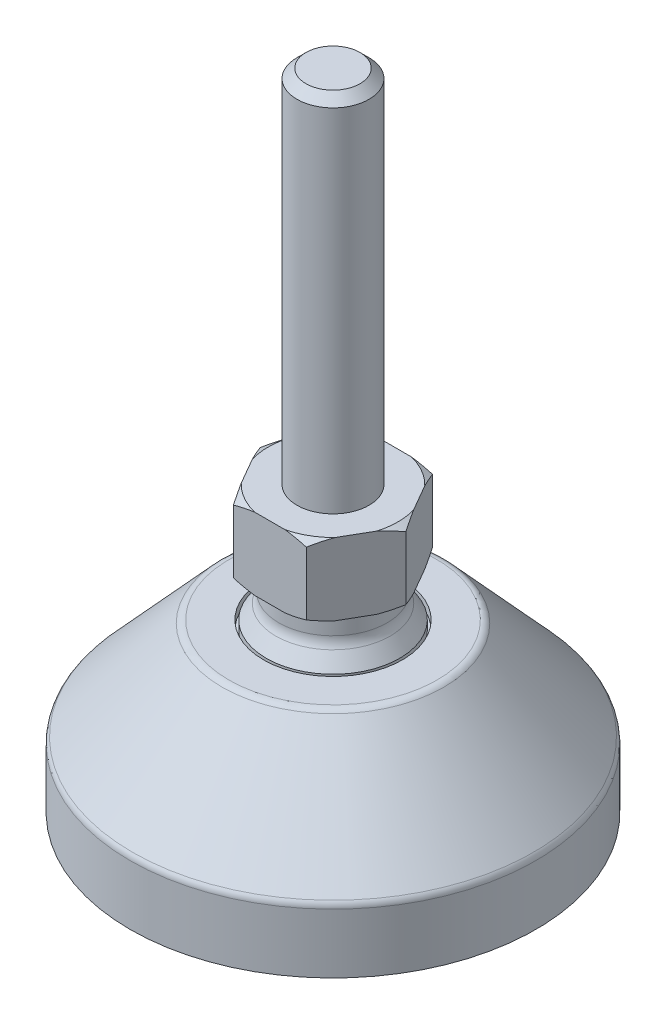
ISO-10303-21;
HEADER;
FILE_DESCRIPTION(('STEP AP214'),'2;1');
FILE_NAME('part.step','',(''),(''),'','','');
FILE_SCHEMA(('AUTOMOTIVE_DESIGN { 1 0 10303 214 1 1 1 1 }'));
ENDSEC;
DATA;
#1=APPLICATION_CONTEXT('core data for automotive mechanical design processes');
#2=APPLICATION_PROTOCOL_DEFINITION('international standard','automotive_design',2000,#1);
#3=PRODUCT_CONTEXT('',#1,'mechanical');
#4=PRODUCT('Part','Part','',(#3));
#5=PRODUCT_RELATED_PRODUCT_CATEGORY('part','',(#4));
#6=PRODUCT_DEFINITION_FORMATION('','',#4);
#7=PRODUCT_DEFINITION_CONTEXT('part definition',#1,'design');
#8=PRODUCT_DEFINITION('design','',#6,#7);
#9=PRODUCT_DEFINITION_SHAPE('','',#8);
#10=(LENGTH_UNIT() NAMED_UNIT(*) SI_UNIT(.MILLI.,.METRE.));
#11=(NAMED_UNIT(*) PLANE_ANGLE_UNIT() SI_UNIT($,.RADIAN.));
#12=(NAMED_UNIT(*) SI_UNIT($,.STERADIAN.) SOLID_ANGLE_UNIT());
#13=UNCERTAINTY_MEASURE_WITH_UNIT(LENGTH_MEASURE(1.E-05),#10,'distance_accuracy_value','');
#14=(GEOMETRIC_REPRESENTATION_CONTEXT(3) GLOBAL_UNCERTAINTY_ASSIGNED_CONTEXT((#13)) GLOBAL_UNIT_ASSIGNED_CONTEXT((#10,
#11,#12)) REPRESENTATION_CONTEXT('',''));
#15=CARTESIAN_POINT('',(0.,0.,0.));
#16=DIRECTION('',(0.,0.,1.));
#17=DIRECTION('',(1.,0.,0.));
#18=AXIS2_PLACEMENT_3D('',#15,#16,#17);
#19=CARTESIAN_POINT('',(0.,0.,0.));
#20=DIRECTION('',(0.,1.,0.));
#21=DIRECTION('',(0.,0.,1.));
#22=AXIS2_PLACEMENT_3D('',#19,#20,#21);
#23=PLANE('',#22);
#24=CARTESIAN_POINT('',(0.,0.,0.));
#25=DIRECTION('',(0.,-1.,0.));
#26=DIRECTION('',(0.,0.,-1.));
#27=AXIS2_PLACEMENT_3D('',#24,#25,#26);
#28=CIRCLE('',#27,13.75);
#29=CARTESIAN_POINT('',(-3.,0.,13.4187369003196));
#30=VERTEX_POINT('',#29);
#31=CARTESIAN_POINT('',(-12.3718430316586,0.,6.));
#32=VERTEX_POINT('',#31);
#33=EDGE_CURVE('E276',#30,#32,#28,.T.);
#34=ORIENTED_EDGE('',*,*,#33,.F.);
#35=DIRECTION('',(0.,0.,1.));
#36=VECTOR('',#35,1.);
#37=CARTESIAN_POINT('',(-3.,0.,6.));
#38=LINE('',#37,#36);
#39=CARTESIAN_POINT('',(-3.,0.,6.));
#40=VERTEX_POINT('',#39);
#41=EDGE_CURVE('E292',#40,#30,#38,.T.);
#42=ORIENTED_EDGE('',*,*,#41,.F.);
#43=DIRECTION('',(1.,0.,0.));
#44=VECTOR('',#43,1.);
#45=CARTESIAN_POINT('',(-12.3718430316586,0.,6.));
#46=LINE('',#45,#44);
#47=EDGE_CURVE('E281',#32,#40,#46,.T.);
#48=ORIENTED_EDGE('',*,*,#47,.F.);
#49=EDGE_LOOP('',(#34,#42,#48));
#50=FACE_BOUND('',#49,.T.);
#51=CARTESIAN_POINT('',(0.,0.,0.));
#52=DIRECTION('',(0.,1.,0.));
#53=DIRECTION('',(0.,0.,1.));
#54=AXIS2_PLACEMENT_3D('',#51,#52,#53);
#55=CIRCLE('',#54,18.);
#56=CARTESIAN_POINT('',(0.,0.,18.));
#57=VERTEX_POINT('',#56);
#58=EDGE_CURVE('E606',#57,#57,#55,.T.);
#59=ORIENTED_EDGE('',*,*,#58,.F.);
#60=EDGE_LOOP('',(#59));
#61=FACE_BOUND('',#60,.T.);
#62=DIRECTION('',(0.,0.,-1.));
#63=VECTOR('',#62,1.);
#64=CARTESIAN_POINT('',(3.,0.,6.));
#65=LINE('',#64,#63);
#66=CARTESIAN_POINT('',(3.,0.,13.4187369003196));
#67=VERTEX_POINT('',#66);
#68=CARTESIAN_POINT('',(3.,0.,6.));
#69=VERTEX_POINT('',#68);
#70=EDGE_CURVE('E350',#67,#69,#65,.T.);
#71=ORIENTED_EDGE('',*,*,#70,.F.);
#72=CARTESIAN_POINT('',(0.,0.,0.));
#73=DIRECTION('',(0.,-1.,0.));
#74=DIRECTION('',(0.,0.,-1.));
#75=AXIS2_PLACEMENT_3D('',#72,#73,#74);
#76=CIRCLE('',#75,13.75);
#77=CARTESIAN_POINT('',(12.3718430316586,0.,6.));
#78=VERTEX_POINT('',#77);
#79=EDGE_CURVE('E356',#78,#67,#76,.T.);
#80=ORIENTED_EDGE('',*,*,#79,.F.);
#81=DIRECTION('',(1.,0.,0.));
#82=VECTOR('',#81,1.);
#83=CARTESIAN_POINT('',(3.,0.,6.));
#84=LINE('',#83,#82);
#85=EDGE_CURVE('E366',#69,#78,#84,.T.);
#86=ORIENTED_EDGE('',*,*,#85,.F.);
#87=EDGE_LOOP('',(#71,#80,#86));
#88=FACE_BOUND('',#87,.T.);
#89=CARTESIAN_POINT('',(0.,0.,0.));
#90=DIRECTION('',(0.,-1.,0.));
#91=DIRECTION('',(0.,0.,-1.));
#92=AXIS2_PLACEMENT_3D('',#89,#90,#91);
#93=CIRCLE('',#92,13.75);
#94=CARTESIAN_POINT('',(-12.3718430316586,0.,-6.));
#95=VERTEX_POINT('',#94);
#96=CARTESIAN_POINT('',(-3.,0.,-13.4187369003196));
#97=VERTEX_POINT('',#96);
#98=EDGE_CURVE('E316',#95,#97,#93,.T.);
#99=ORIENTED_EDGE('',*,*,#98,.F.);
#100=DIRECTION('',(-1.,0.,0.));
#101=VECTOR('',#100,1.);
#102=CARTESIAN_POINT('',(-12.3718430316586,0.,-6.));
#103=LINE('',#102,#101);
#104=CARTESIAN_POINT('',(-3.,0.,-6.));
#105=VERTEX_POINT('',#104);
#106=EDGE_CURVE('E322',#105,#95,#103,.T.);
#107=ORIENTED_EDGE('',*,*,#106,.F.);
#108=DIRECTION('',(0.,0.,1.));
#109=VECTOR('',#108,1.);
#110=CARTESIAN_POINT('',(-3.,0.,-13.4187369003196));
#111=LINE('',#110,#109);
#112=EDGE_CURVE('E332',#97,#105,#111,.T.);
#113=ORIENTED_EDGE('',*,*,#112,.F.);
#114=EDGE_LOOP('',(#99,#107,#113));
#115=FACE_BOUND('',#114,.T.);
#116=CARTESIAN_POINT('',(0.,0.,0.));
#117=DIRECTION('',(0.,-1.,0.));
#118=DIRECTION('',(0.,0.,-1.));
#119=AXIS2_PLACEMENT_3D('',#116,#117,#118);
#120=CIRCLE('',#119,13.75);
#121=CARTESIAN_POINT('',(3.,0.,-13.4187369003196));
#122=VERTEX_POINT('',#121);
#123=CARTESIAN_POINT('',(12.3718430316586,0.,-6.));
#124=VERTEX_POINT('',#123);
#125=EDGE_CURVE('E274',#122,#124,#120,.T.);
#126=ORIENTED_EDGE('',*,*,#125,.F.);
#127=DIRECTION('',(0.,0.,-1.));
#128=VECTOR('',#127,1.);
#129=CARTESIAN_POINT('',(3.,0.,-13.4187369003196));
#130=LINE('',#129,#128);
#131=CARTESIAN_POINT('',(3.,0.,-6.));
#132=VERTEX_POINT('',#131);
#133=EDGE_CURVE('E77',#132,#122,#130,.T.);
#134=ORIENTED_EDGE('',*,*,#133,.F.);
#135=DIRECTION('',(-1.,0.,0.));
#136=VECTOR('',#135,1.);
#137=CARTESIAN_POINT('',(3.,0.,-6.));
#138=LINE('',#137,#136);
#139=EDGE_CURVE('E73',#124,#132,#138,.T.);
#140=ORIENTED_EDGE('',*,*,#139,.F.);
#141=EDGE_LOOP('',(#126,#134,#140));
#142=FACE_BOUND('',#141,.T.);
#143=ADVANCED_FACE('F57',(#50,#61,#88,#115,#142),#23,.F.);
#144=CARTESIAN_POINT('',(0.,26.,0.));
#145=DIRECTION('',(0.,1.,0.));
#146=DIRECTION('',(0.,0.,1.));
#147=AXIS2_PLACEMENT_3D('',#144,#145,#146);
#148=PLANE('',#147);
#149=CARTESIAN_POINT('',(0.,26.,0.));
#150=DIRECTION('',(0.,1.,0.));
#151=DIRECTION('',(0.,0.,1.));
#152=AXIS2_PLACEMENT_3D('',#149,#150,#151);
#153=CIRCLE('',#152,6.);
#154=CARTESIAN_POINT('',(0.,26.,6.));
#155=VERTEX_POINT('',#154);
#156=EDGE_CURVE('E582',#155,#155,#153,.T.);
#157=ORIENTED_EDGE('',*,*,#156,.T.);
#158=EDGE_LOOP('',(#157));
#159=FACE_BOUND('',#158,.T.);
#160=DIRECTION('',(1.,0.,0.));
#161=VECTOR('',#160,1.);
#162=CARTESIAN_POINT('',(-4.04145188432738,26.,7.));
#163=LINE('',#162,#161);
#164=CARTESIAN_POINT('',(-1.6852299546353,26.,7.));
#165=VERTEX_POINT('',#164);
#166=CARTESIAN_POINT('',(1.68522995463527,26.,7.));
#167=VERTEX_POINT('',#166);
#168=EDGE_CURVE('E516',#165,#167,#163,.T.);
#169=ORIENTED_EDGE('',*,*,#168,.F.);
#170=CARTESIAN_POINT('',(0.,26.,0.));
#171=DIRECTION('',(0.,1.,0.));
#172=DIRECTION('',(0.,0.,1.));
#173=AXIS2_PLACEMENT_3D('',#170,#171,#172);
#174=CIRCLE('',#173,7.2);
#175=CARTESIAN_POINT('',(-5.21956284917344,26.,4.95945195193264));
#176=VERTEX_POINT('',#175);
#177=EDGE_CURVE('E384',#176,#165,#174,.T.);
#178=ORIENTED_EDGE('',*,*,#177,.F.);
#179=DIRECTION('',(0.5,0.,0.866025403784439));
#180=VECTOR('',#179,1.);
#181=CARTESIAN_POINT('',(-8.08290376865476,26.,0.));
#182=LINE('',#181,#180);
#183=CARTESIAN_POINT('',(-6.90479280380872,26.,2.04054804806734));
#184=VERTEX_POINT('',#183);
#185=EDGE_CURVE('E552',#184,#176,#182,.T.);
#186=ORIENTED_EDGE('',*,*,#185,.F.);
#187=CARTESIAN_POINT('',(-6.9047928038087,26.,-2.04054804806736));
#188=VERTEX_POINT('',#187);
#189=EDGE_CURVE('E827',#188,#184,#174,.T.);
#190=ORIENTED_EDGE('',*,*,#189,.F.);
#191=DIRECTION('',(-0.5,0.,0.866025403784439));
#192=VECTOR('',#191,1.);
#193=CARTESIAN_POINT('',(-4.04145188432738,26.,-7.));
#194=LINE('',#193,#192);
#195=CARTESIAN_POINT('',(-5.21956284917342,26.,-4.95945195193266));
#196=VERTEX_POINT('',#195);
#197=EDGE_CURVE('E548',#196,#188,#194,.T.);
#198=ORIENTED_EDGE('',*,*,#197,.F.);
#199=CARTESIAN_POINT('',(-1.68522995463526,26.,-7.));
#200=VERTEX_POINT('',#199);
#201=EDGE_CURVE('E822',#200,#196,#174,.T.);
#202=ORIENTED_EDGE('',*,*,#201,.F.);
#203=DIRECTION('',(-1.,0.,0.));
#204=VECTOR('',#203,1.);
#205=CARTESIAN_POINT('',(4.04145188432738,26.,-7.));
#206=LINE('',#205,#204);
#207=CARTESIAN_POINT('',(1.68522995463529,26.,-7.));
#208=VERTEX_POINT('',#207);
#209=EDGE_CURVE('E544',#208,#200,#206,.T.);
#210=ORIENTED_EDGE('',*,*,#209,.F.);
#211=CARTESIAN_POINT('',(5.21956284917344,26.,-4.95945195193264));
#212=VERTEX_POINT('',#211);
#213=EDGE_CURVE('E820',#212,#208,#174,.T.);
#214=ORIENTED_EDGE('',*,*,#213,.F.);
#215=DIRECTION('',(-0.5,0.,-0.866025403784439));
#216=VECTOR('',#215,1.);
#217=CARTESIAN_POINT('',(8.08290376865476,26.,0.));
#218=LINE('',#217,#216);
#219=CARTESIAN_POINT('',(6.90479280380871,26.,-2.04054804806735));
#220=VERTEX_POINT('',#219);
#221=EDGE_CURVE('E540',#220,#212,#218,.T.);
#222=ORIENTED_EDGE('',*,*,#221,.F.);
#223=CARTESIAN_POINT('',(6.9047928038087,26.,2.04054804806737));
#224=VERTEX_POINT('',#223);
#225=EDGE_CURVE('E395',#224,#220,#174,.T.);
#226=ORIENTED_EDGE('',*,*,#225,.F.);
#227=DIRECTION('',(0.5,0.,-0.866025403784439));
#228=VECTOR('',#227,1.);
#229=CARTESIAN_POINT('',(4.04145188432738,26.,7.));
#230=LINE('',#229,#228);
#231=CARTESIAN_POINT('',(5.21956284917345,26.,4.95945195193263));
#232=VERTEX_POINT('',#231);
#233=EDGE_CURVE('E509',#232,#224,#230,.T.);
#234=ORIENTED_EDGE('',*,*,#233,.F.);
#235=EDGE_CURVE('E392',#167,#232,#174,.T.);
#236=ORIENTED_EDGE('',*,*,#235,.F.);
#237=EDGE_LOOP('',(#169,#178,#186,#190,#198,#202,#210,#214,#222,#226,#234,#236));
#238=FACE_BOUND('',#237,.T.);
#239=ADVANCED_FACE('F618',(#159,#238),#148,.F.);
#240=CARTESIAN_POINT('',(0.,34.,0.));
#241=DIRECTION('',(0.,1.,0.));
#242=DIRECTION('',(0.,0.,1.));
#243=AXIS2_PLACEMENT_3D('',#240,#241,#242);
#244=PLANE('',#243);
#245=CARTESIAN_POINT('',(0.,34.,0.));
#246=DIRECTION('',(0.,1.,0.));
#247=DIRECTION('',(0.,0.,1.));
#248=AXIS2_PLACEMENT_3D('',#245,#246,#247);
#249=CIRCLE('',#248,4.);
#250=CARTESIAN_POINT('',(0.,34.,4.));
#251=VERTEX_POINT('',#250);
#252=EDGE_CURVE('E505',#251,#251,#249,.T.);
#253=ORIENTED_EDGE('',*,*,#252,.F.);
#254=EDGE_LOOP('',(#253));
#255=FACE_BOUND('',#254,.T.);
#256=CARTESIAN_POINT('',(0.,34.,0.));
#257=DIRECTION('',(0.,1.,0.));
#258=DIRECTION('',(0.,0.,1.));
#259=AXIS2_PLACEMENT_3D('',#256,#257,#258);
#260=CIRCLE('',#259,7.2);
#261=CARTESIAN_POINT('',(-5.21956284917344,34.,4.95945195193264));
#262=VERTEX_POINT('',#261);
#263=CARTESIAN_POINT('',(-1.68522995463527,34.,7.));
#264=VERTEX_POINT('',#263);
#265=EDGE_CURVE('E391',#262,#264,#260,.T.);
#266=ORIENTED_EDGE('',*,*,#265,.T.);
#267=DIRECTION('',(1.,0.,0.));
#268=VECTOR('',#267,1.);
#269=CARTESIAN_POINT('',(-4.04145188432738,34.,7.));
#270=LINE('',#269,#268);
#271=CARTESIAN_POINT('',(1.68522995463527,34.,7.));
#272=VERTEX_POINT('',#271);
#273=EDGE_CURVE('E532',#264,#272,#270,.T.);
#274=ORIENTED_EDGE('',*,*,#273,.T.);
#275=CARTESIAN_POINT('',(5.21956284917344,34.,4.95945195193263));
#276=VERTEX_POINT('',#275);
#277=EDGE_CURVE('E385',#272,#276,#260,.T.);
#278=ORIENTED_EDGE('',*,*,#277,.T.);
#279=DIRECTION('',(0.5,0.,-0.866025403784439));
#280=VECTOR('',#279,1.);
#281=CARTESIAN_POINT('',(4.04145188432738,34.,7.));
#282=LINE('',#281,#280);
#283=CARTESIAN_POINT('',(6.9047928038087,34.,2.04054804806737));
#284=VERTEX_POINT('',#283);
#285=EDGE_CURVE('E511',#276,#284,#282,.T.);
#286=ORIENTED_EDGE('',*,*,#285,.T.);
#287=CARTESIAN_POINT('',(6.9047928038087,34.,-2.04054804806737));
#288=VERTEX_POINT('',#287);
#289=EDGE_CURVE('E390',#284,#288,#260,.T.);
#290=ORIENTED_EDGE('',*,*,#289,.T.);
#291=DIRECTION('',(-0.5,0.,-0.866025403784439));
#292=VECTOR('',#291,1.);
#293=CARTESIAN_POINT('',(8.08290376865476,34.,0.));
#294=LINE('',#293,#292);
#295=CARTESIAN_POINT('',(5.21956284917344,34.,-4.95945195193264));
#296=VERTEX_POINT('',#295);
#297=EDGE_CURVE('E515',#288,#296,#294,.T.);
#298=ORIENTED_EDGE('',*,*,#297,.T.);
#299=CARTESIAN_POINT('',(1.68522995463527,34.,-7.));
#300=VERTEX_POINT('',#299);
#301=EDGE_CURVE('E860',#296,#300,#260,.T.);
#302=ORIENTED_EDGE('',*,*,#301,.T.);
#303=DIRECTION('',(-1.,0.,0.));
#304=VECTOR('',#303,1.);
#305=CARTESIAN_POINT('',(4.04145188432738,34.,-7.));
#306=LINE('',#305,#304);
#307=CARTESIAN_POINT('',(-1.68522995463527,34.,-7.));
#308=VERTEX_POINT('',#307);
#309=EDGE_CURVE('E520',#300,#308,#306,.T.);
#310=ORIENTED_EDGE('',*,*,#309,.T.);
#311=CARTESIAN_POINT('',(-5.21956284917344,34.,-4.95945195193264));
#312=VERTEX_POINT('',#311);
#313=EDGE_CURVE('E857',#308,#312,#260,.T.);
#314=ORIENTED_EDGE('',*,*,#313,.T.);
#315=DIRECTION('',(-0.5,0.,0.866025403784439));
#316=VECTOR('',#315,1.);
#317=CARTESIAN_POINT('',(-4.04145188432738,34.,-7.));
#318=LINE('',#317,#316);
#319=CARTESIAN_POINT('',(-6.90479280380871,34.,-2.04054804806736));
#320=VERTEX_POINT('',#319);
#321=EDGE_CURVE('E524',#312,#320,#318,.T.);
#322=ORIENTED_EDGE('',*,*,#321,.T.);
#323=CARTESIAN_POINT('',(-6.90479280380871,34.,2.04054804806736));
#324=VERTEX_POINT('',#323);
#325=EDGE_CURVE('E855',#320,#324,#260,.T.);
#326=ORIENTED_EDGE('',*,*,#325,.T.);
#327=DIRECTION('',(0.5,0.,0.866025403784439));
#328=VECTOR('',#327,1.);
#329=CARTESIAN_POINT('',(-8.08290376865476,34.,0.));
#330=LINE('',#329,#328);
#331=EDGE_CURVE('E528',#324,#262,#330,.T.);
#332=ORIENTED_EDGE('',*,*,#331,.T.);
#333=EDGE_LOOP('',(#266,#274,#278,#286,#290,#298,#302,#310,#314,#322,#326,#332));
#334=FACE_BOUND('',#333,.T.);
#335=ADVANCED_FACE('F429',(#255,#334),#244,.T.);
#336=CARTESIAN_POINT('',(0.,21.,0.));
#337=DIRECTION('',(0.,1.,0.));
#338=DIRECTION('',(0.,0.,1.));
#339=AXIS2_PLACEMENT_3D('',#336,#337,#338);
#340=PLANE('',#339);
#341=CARTESIAN_POINT('',(0.,21.,0.));
#342=DIRECTION('',(0.,1.,0.));
#343=DIRECTION('',(0.,0.,1.));
#344=AXIS2_PLACEMENT_3D('',#341,#342,#343);
#345=CIRCLE('',#344,11.558920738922);
#346=CARTESIAN_POINT('',(0.,21.,11.558920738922));
#347=VERTEX_POINT('',#346);
#348=EDGE_CURVE('E727',#347,#347,#345,.T.);
#349=ORIENTED_EDGE('',*,*,#348,.T.);
#350=EDGE_LOOP('',(#349));
#351=FACE_BOUND('',#350,.T.);
#352=CARTESIAN_POINT('',(0.,21.,0.));
#353=DIRECTION('',(0.,1.,0.));
#354=DIRECTION('',(0.,0.,1.));
#355=AXIS2_PLACEMENT_3D('',#352,#353,#354);
#356=CIRCLE('',#355,7.7);
#357=CARTESIAN_POINT('',(0.,21.,7.7));
#358=VERTEX_POINT('',#357);
#359=EDGE_CURVE('E591',#358,#358,#356,.T.);
#360=ORIENTED_EDGE('',*,*,#359,.F.);
#361=EDGE_LOOP('',(#360));
#362=FACE_BOUND('',#361,.T.);
#363=ADVANCED_FACE('F1075',(#351,#362),#340,.T.);
#364=CARTESIAN_POINT('',(0.,2.5,0.));
#365=DIRECTION('',(0.,-1.,0.));
#366=DIRECTION('',(0.,0.,-1.));
#367=AXIS2_PLACEMENT_3D('',#364,#365,#366);
#368=CYLINDRICAL_SURFACE('',#367,18.);
#369=CARTESIAN_POINT('',(0.,2.5,0.));
#370=DIRECTION('',(0.,1.,0.));
#371=DIRECTION('',(0.,0.,1.));
#372=AXIS2_PLACEMENT_3D('',#369,#370,#371);
#373=CIRCLE('',#372,18.);
#374=CARTESIAN_POINT('',(0.,2.5,18.));
#375=VERTEX_POINT('',#374);
#376=EDGE_CURVE('E607',#375,#375,#373,.T.);
#377=ORIENTED_EDGE('',*,*,#376,.F.);
#378=EDGE_LOOP('',(#377));
#379=FACE_BOUND('',#378,.T.);
#380=ORIENTED_EDGE('',*,*,#58,.T.);
#381=EDGE_LOOP('',(#380));
#382=FACE_BOUND('',#381,.T.);
#383=ADVANCED_FACE('F614',(#379,#382),#368,.T.);
#384=CARTESIAN_POINT('',(0.,9.5,0.));
#385=DIRECTION('',(0.,-1.,0.));
#386=DIRECTION('',(0.,0.,-1.));
#387=AXIS2_PLACEMENT_3D('',#384,#385,#386);
#388=CYLINDRICAL_SURFACE('',#387,22.5);
#389=CARTESIAN_POINT('',(0.,9.11215128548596,0.));
#390=DIRECTION('',(0.,-1.,0.));
#391=DIRECTION('',(0.,0.,-1.));
#392=AXIS2_PLACEMENT_3D('',#389,#390,#391);
#393=CIRCLE('',#392,22.5);
#394=CARTESIAN_POINT('',(0.,9.11215128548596,-22.5));
#395=VERTEX_POINT('',#394);
#396=EDGE_CURVE('E730',#395,#395,#393,.T.);
#397=ORIENTED_EDGE('',*,*,#396,.T.);
#398=EDGE_LOOP('',(#397));
#399=FACE_BOUND('',#398,.T.);
#400=CARTESIAN_POINT('',(0.,2.5,0.));
#401=DIRECTION('',(0.,1.,0.));
#402=DIRECTION('',(0.,0.,1.));
#403=AXIS2_PLACEMENT_3D('',#400,#401,#402);
#404=CIRCLE('',#403,22.5);
#405=CARTESIAN_POINT('',(0.,2.5,22.5));
#406=VERTEX_POINT('',#405);
#407=EDGE_CURVE('E599',#406,#406,#404,.T.);
#408=ORIENTED_EDGE('',*,*,#407,.T.);
#409=EDGE_LOOP('',(#408));
#410=FACE_BOUND('',#409,.T.);
#411=ADVANCED_FACE('F1089',(#399,#410),#388,.T.);
#412=CARTESIAN_POINT('',(0.,2.5,0.));
#413=DIRECTION('',(0.,1.,0.));
#414=DIRECTION('',(0.,0.,1.));
#415=AXIS2_PLACEMENT_3D('',#412,#413,#414);
#416=PLANE('',#415);
#417=ORIENTED_EDGE('',*,*,#376,.T.);
#418=EDGE_LOOP('',(#417));
#419=FACE_BOUND('',#418,.T.);
#420=ORIENTED_EDGE('',*,*,#407,.F.);
#421=EDGE_LOOP('',(#420));
#422=FACE_BOUND('',#421,.T.);
#423=ADVANCED_FACE('F1095',(#419,#422),#416,.F.);
#424=CARTESIAN_POINT('',(0.,21.,0.));
#425=DIRECTION('',(0.,-1.,0.));
#426=DIRECTION('',(0.,0.,-1.));
#427=AXIS2_PLACEMENT_3D('',#424,#425,#426);
#428=CONICAL_SURFACE('',#427,12.,0.739974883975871);
#429=CARTESIAN_POINT('',(0.,9.7864206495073,0.));
#430=DIRECTION('',(0.,-1.,0.));
#431=DIRECTION('',(0.,0.,-1.));
#432=AXIS2_PLACEMENT_3D('',#429,#430,#431);
#433=CIRCLE('',#432,22.2384854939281);
#434=CARTESIAN_POINT('',(0.,9.7864206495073,-22.2384854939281));
#435=VERTEX_POINT('',#434);
#436=EDGE_CURVE('E736',#435,#435,#433,.F.);
#437=ORIENTED_EDGE('',*,*,#436,.T.);
#438=EDGE_LOOP('',(#437));
#439=FACE_BOUND('',#438,.T.);
#440=CARTESIAN_POINT('',(0.,20.6742693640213,0.));
#441=DIRECTION('',(0.,1.,0.));
#442=DIRECTION('',(0.,0.,1.));
#443=AXIS2_PLACEMENT_3D('',#440,#441,#442);
#444=CIRCLE('',#443,12.2974062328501);
#445=CARTESIAN_POINT('',(0.,20.6742693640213,12.2974062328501));
#446=VERTEX_POINT('',#445);
#447=EDGE_CURVE('E724',#446,#446,#444,.F.);
#448=ORIENTED_EDGE('',*,*,#447,.T.);
#449=EDGE_LOOP('',(#448));
#450=FACE_BOUND('',#449,.T.);
#451=ADVANCED_FACE('F1104',(#439,#450),#428,.T.);
#452=CARTESIAN_POINT('',(0.,20.,0.));
#453=DIRECTION('',(0.,1.,0.));
#454=DIRECTION('',(0.,0.,1.));
#455=AXIS2_PLACEMENT_3D('',#452,#453,#454);
#456=CYLINDRICAL_SURFACE('',#455,7.7);
#457=CARTESIAN_POINT('',(0.,20.,0.));
#458=DIRECTION('',(0.,1.,0.));
#459=DIRECTION('',(0.,0.,1.));
#460=AXIS2_PLACEMENT_3D('',#457,#458,#459);
#461=CIRCLE('',#460,7.7);
#462=CARTESIAN_POINT('',(0.,20.,7.7));
#463=VERTEX_POINT('',#462);
#464=EDGE_CURVE('E595',#463,#463,#461,.T.);
#465=ORIENTED_EDGE('',*,*,#464,.F.);
#466=EDGE_LOOP('',(#465));
#467=FACE_BOUND('',#466,.T.);
#468=ORIENTED_EDGE('',*,*,#359,.T.);
#469=EDGE_LOOP('',(#468));
#470=FACE_BOUND('',#469,.T.);
#471=ADVANCED_FACE('F1109',(#467,#470),#456,.F.);
#472=CARTESIAN_POINT('',(0.,20.,0.));
#473=DIRECTION('',(0.,1.,0.));
#474=DIRECTION('',(0.,0.,1.));
#475=AXIS2_PLACEMENT_3D('',#472,#473,#474);
#476=PLANE('',#475);
#477=CARTESIAN_POINT('',(0.,20.,0.));
#478=DIRECTION('',(0.,1.,0.));
#479=DIRECTION('',(0.,0.,1.));
#480=AXIS2_PLACEMENT_3D('',#477,#478,#479);
#481=CIRCLE('',#480,7.4);
#482=CARTESIAN_POINT('',(0.,20.,7.4));
#483=VERTEX_POINT('',#482);
#484=EDGE_CURVE('E587',#483,#483,#481,.T.);
#485=ORIENTED_EDGE('',*,*,#484,.F.);
#486=EDGE_LOOP('',(#485));
#487=FACE_BOUND('',#486,.T.);
#488=ORIENTED_EDGE('',*,*,#464,.T.);
#489=EDGE_LOOP('',(#488));
#490=FACE_BOUND('',#489,.T.);
#491=ADVANCED_FACE('F1326',(#487,#490),#476,.T.);
#492=CARTESIAN_POINT('',(0.,20.,0.));
#493=DIRECTION('',(0.,1.,0.));
#494=DIRECTION('',(0.,0.,1.));
#495=AXIS2_PLACEMENT_3D('',#492,#493,#494);
#496=CYLINDRICAL_SURFACE('',#495,7.4);
#497=ORIENTED_EDGE('',*,*,#484,.T.);
#498=EDGE_LOOP('',(#497));
#499=FACE_BOUND('',#498,.T.);
#500=CARTESIAN_POINT('',(0.,21.,0.));
#501=DIRECTION('',(0.,1.,0.));
#502=DIRECTION('',(0.,0.,1.));
#503=AXIS2_PLACEMENT_3D('',#500,#501,#502);
#504=CIRCLE('',#503,7.4);
#505=CARTESIAN_POINT('',(0.,21.,7.4));
#506=VERTEX_POINT('',#505);
#507=EDGE_CURVE('E586',#506,#506,#504,.T.);
#508=ORIENTED_EDGE('',*,*,#507,.F.);
#509=EDGE_LOOP('',(#508));
#510=FACE_BOUND('',#509,.T.);
#511=ADVANCED_FACE('F1135',(#499,#510),#496,.T.);
#512=CARTESIAN_POINT('',(0.,23.1,0.));
#513=DIRECTION('',(0.,-1.,0.));
#514=DIRECTION('',(0.,0.,-1.));
#515=AXIS2_PLACEMENT_3D('',#512,#513,#514);
#516=CONICAL_SURFACE('',#515,6.,0.588002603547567);
#517=CARTESIAN_POINT('',(0.,22.5961508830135,0.));
#518=DIRECTION('',(0.,1.,0.));
#519=DIRECTION('',(0.,0.,1.));
#520=AXIS2_PLACEMENT_3D('',#517,#518,#519);
#521=CIRCLE('',#520,6.33589941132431);
#522=CARTESIAN_POINT('',(0.,22.5961508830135,6.33589941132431));
#523=VERTEX_POINT('',#522);
#524=EDGE_CURVE('E12',#523,#523,#521,.F.);
#525=ORIENTED_EDGE('',*,*,#524,.T.);
#526=EDGE_LOOP('',(#525));
#527=FACE_BOUND('',#526,.T.);
#528=ORIENTED_EDGE('',*,*,#507,.T.);
#529=EDGE_LOOP('',(#528));
#530=FACE_BOUND('',#529,.T.);
#531=ADVANCED_FACE('F1129',(#527,#530),#516,.T.);
#532=CARTESIAN_POINT('',(0.,26.,0.));
#533=DIRECTION('',(0.,-1.,0.));
#534=DIRECTION('',(0.,0.,-1.));
#535=AXIS2_PLACEMENT_3D('',#532,#533,#534);
#536=CYLINDRICAL_SURFACE('',#535,6.);
#537=CARTESIAN_POINT('',(0.,23.705551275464,0.));
#538=DIRECTION('',(0.,1.,0.));
#539=DIRECTION('',(0.,0.,1.));
#540=AXIS2_PLACEMENT_3D('',#537,#538,#539);
#541=CIRCLE('',#540,6.);
#542=CARTESIAN_POINT('',(0.,23.705551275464,6.));
#543=VERTEX_POINT('',#542);
#544=EDGE_CURVE('E66',#543,#543,#541,.T.);
#545=ORIENTED_EDGE('',*,*,#544,.T.);
#546=EDGE_LOOP('',(#545));
#547=FACE_BOUND('',#546,.T.);
#548=ORIENTED_EDGE('',*,*,#156,.F.);
#549=EDGE_LOOP('',(#548));
#550=FACE_BOUND('',#549,.T.);
#551=ADVANCED_FACE('F1134',(#547,#550),#536,.T.);
#552=CARTESIAN_POINT('',(4.04145188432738,34.,7.));
#553=DIRECTION('',(-0.866025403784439,0.,-0.5));
#554=DIRECTION('',(-0.5,0.,0.866025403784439));
#555=AXIS2_PLACEMENT_3D('',#552,#553,#554);
#556=PLANE('',#555);
#557=DIRECTION('',(0.,-1.,0.));
#558=VECTOR('',#557,1.);
#559=CARTESIAN_POINT('',(8.08290376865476,34.,0.));
#560=LINE('',#559,#558);
#561=CARTESIAN_POINT('',(8.08290376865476,33.5,0.));
#562=VERTEX_POINT('',#561);
#563=CARTESIAN_POINT('',(8.08290376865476,26.5,0.));
#564=VERTEX_POINT('',#563);
#565=EDGE_CURVE('E578',#562,#564,#560,.T.);
#566=ORIENTED_EDGE('',*,*,#565,.F.);
#567=CARTESIAN_POINT('',(10.8883712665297,31.3250503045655,-4.85921224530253));
#568=CARTESIAN_POINT('',(10.7593149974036,31.443354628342,-4.63568023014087));
#569=CARTESIAN_POINT('',(10.6299546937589,31.5603533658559,-4.41162161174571));
#570=CARTESIAN_POINT('',(10.3704955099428,31.7911160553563,-3.96222512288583));
#571=CARTESIAN_POINT('',(10.240396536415,31.9048795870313,-3.73688709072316));
#572=CARTESIAN_POINT('',(9.97893004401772,32.1288881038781,-3.28401384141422));
#573=CARTESIAN_POINT('',(9.84755974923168,32.239120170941,-3.05647381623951));
#574=CARTESIAN_POINT('',(9.58384515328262,32.4548104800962,-2.59970673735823));
#575=CARTESIAN_POINT('',(9.45150088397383,32.5602688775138,-2.37047973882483));
#576=CARTESIAN_POINT('',(9.1826241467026,32.7677110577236,-1.9047715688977));
#577=CARTESIAN_POINT('',(9.04606536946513,32.8695590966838,-1.66824482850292));
#578=CARTESIAN_POINT('',(8.77158710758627,33.065719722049,-1.19283453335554));
#579=CARTESIAN_POINT('',(8.63366755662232,33.160031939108,-0.953950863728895));
#580=CARTESIAN_POINT('',(8.35644434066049,33.3392409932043,-0.473786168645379));
#581=CARTESIAN_POINT('',(8.21714219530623,33.4241471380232,-0.232507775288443));
#582=CARTESIAN_POINT('',(7.93693537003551,33.58248846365,0.252824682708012));
#583=CARTESIAN_POINT('',(7.79603090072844,33.6559251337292,0.496878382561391));
#584=CARTESIAN_POINT('',(7.45675155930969,33.8150176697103,1.08452743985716));
#585=CARTESIAN_POINT('',(7.25757276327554,33.8941169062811,1.42951523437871));
#586=CARTESIAN_POINT('',(6.95687969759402,33.9872500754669,1.95033090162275));
#587=CARTESIAN_POINT('',(6.85633452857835,34.0140409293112,2.12448024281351));
#588=CARTESIAN_POINT('',(6.65472877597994,34.0584104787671,2.47367164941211));
#589=CARTESIAN_POINT('',(6.5536681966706,34.0759892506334,2.64871370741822));
#590=CARTESIAN_POINT('',(6.35234615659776,34.1012589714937,2.9974137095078));
#591=CARTESIAN_POINT('',(6.25208803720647,34.1090559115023,3.17106586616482));
#592=CARTESIAN_POINT('',(6.05150135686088,34.1148708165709,3.51849218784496));
#593=CARTESIAN_POINT('',(5.95117279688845,34.1128889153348,3.69226635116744));
#594=CARTESIAN_POINT('',(5.75067102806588,34.0992071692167,4.03954560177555));
#595=CARTESIAN_POINT('',(5.65049783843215,34.0875062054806,4.2130506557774));
#596=CARTESIAN_POINT('',(5.45053601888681,34.0547474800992,4.55939468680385));
#597=CARTESIAN_POINT('',(5.35074740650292,34.0336892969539,4.73223363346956));
#598=CARTESIAN_POINT('',(5.10920191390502,33.9719332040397,5.15060269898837));
#599=CARTESIAN_POINT('',(4.96773359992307,33.9266880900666,5.39563300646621));
#600=CARTESIAN_POINT('',(4.6862667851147,33.8206045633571,5.88314783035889));
#601=CARTESIAN_POINT('',(4.54626858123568,33.7597630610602,6.12563183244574));
#602=CARTESIAN_POINT('',(4.26772270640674,33.6248944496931,6.60808743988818));
#603=CARTESIAN_POINT('',(4.12917680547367,33.5508528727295,6.84805597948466));
#604=CARTESIAN_POINT('',(3.85366553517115,33.3919581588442,7.32525549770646));
#605=CARTESIAN_POINT('',(3.71670009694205,33.3071054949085,7.56248659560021));
#606=CARTESIAN_POINT('',(3.44278828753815,33.1276590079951,8.03691576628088));
#607=CARTESIAN_POINT('',(3.30585726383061,33.0329721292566,8.27408725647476));
#608=CARTESIAN_POINT('',(3.03331395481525,32.8363210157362,8.74614611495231));
#609=CARTESIAN_POINT('',(2.89770168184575,32.7343567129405,8.98103346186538));
#610=CARTESIAN_POINT('',(2.62770813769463,32.5245884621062,9.44867599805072));
#611=CARTESIAN_POINT('',(2.49332618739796,32.4167879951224,9.68143236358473));
#612=CARTESIAN_POINT('',(2.22555657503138,32.1963855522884,10.1452229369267));
#613=CARTESIAN_POINT('',(2.09216889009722,32.0837836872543,10.3762571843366));
#614=CARTESIAN_POINT('',(1.89840284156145,31.9168140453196,10.7118698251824));
#615=CARTESIAN_POINT('',(1.83768684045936,31.8640053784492,10.8170330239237));
#616=CARTESIAN_POINT('',(1.71642135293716,31.7576306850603,11.0270710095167));
#617=CARTESIAN_POINT('',(1.65587186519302,31.7040646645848,11.1319457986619));
#618=CARTESIAN_POINT('',(1.53535146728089,31.5966164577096,11.3406932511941));
#619=CARTESIAN_POINT('',(1.47537947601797,31.5427391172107,11.4445677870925));
#620=CARTESIAN_POINT('',(1.35557772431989,31.4343539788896,11.6520705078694));
#621=CARTESIAN_POINT('',(1.29574796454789,31.3798461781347,11.7556986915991));
#622=CARTESIAN_POINT('',(1.23598438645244,31.3250503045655,11.8592122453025));
#623=B_SPLINE_CURVE_WITH_KNOTS('',3,(#567,#568,#569,#570,#571,#572,#573,#574,#575,#576,#577,
#578,#579,#580,#581,#582,#583,#584,#585,#586,#587,#588,#589,#590,#591,#592,#593,#594,#595,#596,
#597,#598,#599,#600,#601,#602,#603,#604,#605,#606,#607,#608,#609,#610,#611,#612,#613,#614,#615,
#616,#617,#618,#619,#620,#621,#622),.UNSPECIFIED.,.F.,.F.,(4,2,2,2,2,2,2,2,2,2,2,2,2,2,2,2,2,2,
2,2,2,2,2,2,2,2,2,4),(0.,0.851808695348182,1.70372755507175,2.55847131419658,3.41318724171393,
4.287565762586,5.16198711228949,6.03553529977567,6.90896996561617,8.12598201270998,
8.73440814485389,9.34282924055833,9.94459919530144,10.5463609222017,11.1481919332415,
11.7500500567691,12.609105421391,13.4683310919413,14.3285043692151,15.1886400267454,
16.0578210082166,16.9270101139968,17.7956863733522,18.6643425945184,19.0615943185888,
19.4588428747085,19.8533077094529,20.2477743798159),.UNSPECIFIED.);
#624=EDGE_CURVE('E510',#562,#284,#623,.T.);
#625=ORIENTED_EDGE('',*,*,#624,.T.);
#626=ORIENTED_EDGE('',*,*,#285,.F.);
#627=CARTESIAN_POINT('',(4.04145188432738,33.5,7.));
#628=VERTEX_POINT('',#627);
#629=EDGE_CURVE('E778',#276,#628,#623,.T.);
#630=ORIENTED_EDGE('',*,*,#629,.T.);
#631=DIRECTION('',(0.,-1.,0.));
#632=VECTOR('',#631,1.);
#633=CARTESIAN_POINT('',(4.04145188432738,34.,7.));
#634=LINE('',#633,#632);
#635=CARTESIAN_POINT('',(4.04145188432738,26.5,7.));
#636=VERTEX_POINT('',#635);
#637=EDGE_CURVE('E536',#628,#636,#634,.T.);
#638=ORIENTED_EDGE('',*,*,#637,.T.);
#639=CARTESIAN_POINT('',(1.23598438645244,28.6749496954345,11.8592122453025));
#640=CARTESIAN_POINT('',(1.36504065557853,28.556645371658,11.6356802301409));
#641=CARTESIAN_POINT('',(1.49440095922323,28.4396466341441,11.4116216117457));
#642=CARTESIAN_POINT('',(1.75386014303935,28.2088839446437,10.9622251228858));
#643=CARTESIAN_POINT('',(1.88395911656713,28.0951204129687,10.7368870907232));
#644=CARTESIAN_POINT('',(2.14542560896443,27.8711118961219,10.2840138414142));
#645=CARTESIAN_POINT('',(2.27679590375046,27.760879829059,10.0564738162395));
#646=CARTESIAN_POINT('',(2.54051049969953,27.5451895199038,9.59970673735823));
#647=CARTESIAN_POINT('',(2.67285476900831,27.4397311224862,9.37047973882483));
#648=CARTESIAN_POINT('',(2.94173150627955,27.2322889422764,8.9047715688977));
#649=CARTESIAN_POINT('',(3.07829028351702,27.1304409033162,8.66824482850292));
#650=CARTESIAN_POINT('',(3.35276854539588,26.934280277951,8.19283453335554));
#651=CARTESIAN_POINT('',(3.49068809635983,26.839968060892,7.95395086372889));
#652=CARTESIAN_POINT('',(3.76791131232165,26.6607590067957,7.47378616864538));
#653=CARTESIAN_POINT('',(3.90721345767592,26.5758528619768,7.23250777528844));
#654=CARTESIAN_POINT('',(4.18742028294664,26.41751153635,6.74717531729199));
#655=CARTESIAN_POINT('',(4.32832475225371,26.3440748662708,6.50312161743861));
#656=CARTESIAN_POINT('',(4.66760409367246,26.1849823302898,5.91547256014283));
#657=CARTESIAN_POINT('',(4.86678288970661,26.1058830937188,5.57048476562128));
#658=CARTESIAN_POINT('',(5.16747595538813,26.0127499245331,5.04966909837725));
#659=CARTESIAN_POINT('',(5.26802112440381,25.9859590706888,4.87551975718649));
#660=CARTESIAN_POINT('',(5.46962687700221,25.9415895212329,4.52632835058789));
#661=CARTESIAN_POINT('',(5.57068745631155,25.9240107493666,4.35128629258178));
#662=CARTESIAN_POINT('',(5.77200949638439,25.8987410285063,4.0025862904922));
#663=CARTESIAN_POINT('',(5.87226761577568,25.8909440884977,3.82893413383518));
#664=CARTESIAN_POINT('',(6.07285429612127,25.8851291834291,3.48150781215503));
#665=CARTESIAN_POINT('',(6.1731828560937,25.8871110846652,3.30773364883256));
#666=CARTESIAN_POINT('',(6.37368462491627,25.9007928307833,2.96045439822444));
#667=CARTESIAN_POINT('',(6.47385781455,25.9124937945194,2.78694934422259));
#668=CARTESIAN_POINT('',(6.67381963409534,25.9452525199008,2.44060531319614));
#669=CARTESIAN_POINT('',(6.77360824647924,25.9663107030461,2.26776636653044));
#670=CARTESIAN_POINT('',(7.01515373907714,26.0280667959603,1.84939730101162));
#671=CARTESIAN_POINT('',(7.15662205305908,26.0733119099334,1.60436699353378));
#672=CARTESIAN_POINT('',(7.43808886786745,26.1793954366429,1.1168521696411));
#673=CARTESIAN_POINT('',(7.57808707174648,26.2402369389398,0.874368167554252));
#674=CARTESIAN_POINT('',(7.85663294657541,26.3751055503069,0.391912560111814));
#675=CARTESIAN_POINT('',(7.99517884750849,26.4491471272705,0.151944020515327));
#676=CARTESIAN_POINT('',(8.270690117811,26.6080418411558,-0.325255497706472));
#677=CARTESIAN_POINT('',(8.40765555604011,26.6928945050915,-0.562486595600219));
#678=CARTESIAN_POINT('',(8.68156736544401,26.8723409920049,-1.0369157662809));
#679=CARTESIAN_POINT('',(8.81849838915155,26.9670278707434,-1.27408725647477));
#680=CARTESIAN_POINT('',(9.09104169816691,27.1636789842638,-1.74614611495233));
#681=CARTESIAN_POINT('',(9.22665397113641,27.2656432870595,-1.9810334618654));
#682=CARTESIAN_POINT('',(9.49664751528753,27.4754115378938,-2.44867599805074));
#683=CARTESIAN_POINT('',(9.6310294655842,27.5832120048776,-2.68143236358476));
#684=CARTESIAN_POINT('',(9.89879907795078,27.8036144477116,-3.14522293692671));
#685=CARTESIAN_POINT('',(10.0321867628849,27.9162163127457,-3.37625718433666));
#686=CARTESIAN_POINT('',(10.2259528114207,28.0831859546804,-3.71186982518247));
#687=CARTESIAN_POINT('',(10.2866688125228,28.1359946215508,-3.8170330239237));
#688=CARTESIAN_POINT('',(10.407934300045,28.2423693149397,-4.02707100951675));
#689=CARTESIAN_POINT('',(10.4684837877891,28.2959353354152,-4.13194579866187));
#690=CARTESIAN_POINT('',(10.5890041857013,28.4033835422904,-4.3406932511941));
#691=CARTESIAN_POINT('',(10.6489761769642,28.4572608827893,-4.44456778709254));
#692=CARTESIAN_POINT('',(10.7687779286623,28.5656460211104,-4.65207050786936));
#693=CARTESIAN_POINT('',(10.8286076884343,28.6201538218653,-4.75569869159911));
#694=CARTESIAN_POINT('',(10.8883712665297,28.6749496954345,-4.85921224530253));
#695=B_SPLINE_CURVE_WITH_KNOTS('',3,(#639,#640,#641,#642,#643,#644,#645,#646,#647,#648,#649,
#650,#651,#652,#653,#654,#655,#656,#657,#658,#659,#660,#661,#662,#663,#664,#665,#666,#667,#668,
#669,#670,#671,#672,#673,#674,#675,#676,#677,#678,#679,#680,#681,#682,#683,#684,#685,#686,#687,
#688,#689,#690,#691,#692,#693,#694),.UNSPECIFIED.,.F.,.F.,(4,2,2,2,2,2,2,2,2,2,2,2,2,2,2,2,2,2,
2,2,2,2,2,2,2,2,2,4),(0.,0.851808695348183,1.70372755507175,2.55847131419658,3.41318724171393,
4.287565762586,5.1619871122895,6.03553529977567,6.90896996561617,8.12598201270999,
8.73440814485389,9.34282924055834,9.94459919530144,10.5463609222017,11.1481919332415,
11.7500500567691,12.6091054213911,13.4683310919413,14.3285043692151,15.1886400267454,
16.0578210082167,16.9270101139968,17.7956863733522,18.6643425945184,19.0615943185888,
19.4588428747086,19.8533077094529,20.2477743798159),.UNSPECIFIED.);
#696=EDGE_CURVE('E389',#636,#232,#695,.T.);
#697=ORIENTED_EDGE('',*,*,#696,.T.);
#698=ORIENTED_EDGE('',*,*,#233,.T.);
#699=EDGE_CURVE('E406',#224,#564,#695,.T.);
#700=ORIENTED_EDGE('',*,*,#699,.T.);
#701=EDGE_LOOP('',(#566,#625,#626,#630,#638,#697,#698,#700));
#702=FACE_BOUND('',#701,.T.);
#703=ADVANCED_FACE('F413',(#702),#556,.F.);
#704=CARTESIAN_POINT('',(8.08290376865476,34.,0.));
#705=DIRECTION('',(-0.866025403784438,0.,0.5));
#706=DIRECTION('',(0.5,0.,0.866025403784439));
#707=AXIS2_PLACEMENT_3D('',#704,#705,#706);
#708=PLANE('',#707);
#709=DIRECTION('',(0.,-1.,0.));
#710=VECTOR('',#709,1.);
#711=CARTESIAN_POINT('',(4.04145188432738,34.,-7.));
#712=LINE('',#711,#710);
#713=CARTESIAN_POINT('',(4.04145188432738,33.5,-7.));
#714=VERTEX_POINT('',#713);
#715=CARTESIAN_POINT('',(4.04145188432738,26.5,-7.));
#716=VERTEX_POINT('',#715);
#717=EDGE_CURVE('E574',#714,#716,#712,.T.);
#718=ORIENTED_EDGE('',*,*,#717,.F.);
#719=CARTESIAN_POINT('',(1.23598438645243,31.3250503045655,-11.8592122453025));
#720=CARTESIAN_POINT('',(1.36504065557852,31.443354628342,-11.6356802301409));
#721=CARTESIAN_POINT('',(1.49440095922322,31.5603533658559,-11.4116216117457));
#722=CARTESIAN_POINT('',(1.75386014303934,31.7911160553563,-10.9622251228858));
#723=CARTESIAN_POINT('',(1.88395911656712,31.9048795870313,-10.7368870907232));
#724=CARTESIAN_POINT('',(2.14542560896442,32.1288881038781,-10.2840138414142));
#725=CARTESIAN_POINT('',(2.27679590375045,32.239120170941,-10.0564738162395));
#726=CARTESIAN_POINT('',(2.54051049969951,32.4548104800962,-9.59970673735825));
#727=CARTESIAN_POINT('',(2.6728547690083,32.5602688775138,-9.37047973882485));
#728=CARTESIAN_POINT('',(2.94173150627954,32.7677110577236,-8.90477156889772));
#729=CARTESIAN_POINT('',(3.07829028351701,32.8695590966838,-8.66824482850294));
#730=CARTESIAN_POINT('',(3.35276854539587,33.065719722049,-8.19283453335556));
#731=CARTESIAN_POINT('',(3.49068809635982,33.160031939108,-7.95395086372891));
#732=CARTESIAN_POINT('',(3.76791131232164,33.3392409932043,-7.47378616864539));
#733=CARTESIAN_POINT('',(3.90721345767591,33.4241471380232,-7.23250777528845));
#734=CARTESIAN_POINT('',(4.18742028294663,33.58248846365,-6.747175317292));
#735=CARTESIAN_POINT('',(4.3283247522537,33.6559251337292,-6.50312161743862));
#736=CARTESIAN_POINT('',(4.66760409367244,33.8150176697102,-5.91547256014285));
#737=CARTESIAN_POINT('',(4.8667828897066,33.8941169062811,-5.5704847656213));
#738=CARTESIAN_POINT('',(5.16747595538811,33.9872500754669,-5.04966909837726));
#739=CARTESIAN_POINT('',(5.26802112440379,34.0140409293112,-4.87551975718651));
#740=CARTESIAN_POINT('',(5.4696268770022,34.0584104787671,-4.52632835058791));
#741=CARTESIAN_POINT('',(5.57068745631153,34.0759892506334,-4.3512862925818));
#742=CARTESIAN_POINT('',(5.77200949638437,34.1012589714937,-4.00258629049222));
#743=CARTESIAN_POINT('',(5.87226761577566,34.1090559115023,-3.8289341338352));
#744=CARTESIAN_POINT('',(6.07285429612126,34.1148708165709,-3.48150781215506));
#745=CARTESIAN_POINT('',(6.17318285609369,34.1128889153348,-3.30773364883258));
#746=CARTESIAN_POINT('',(6.37368462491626,34.0992071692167,-2.96045439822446));
#747=CARTESIAN_POINT('',(6.47385781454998,34.0875062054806,-2.78694934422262));
#748=CARTESIAN_POINT('',(6.67381963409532,34.0547474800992,-2.44060531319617));
#749=CARTESIAN_POINT('',(6.77360824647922,34.0336892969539,-2.26776636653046));
#750=CARTESIAN_POINT('',(7.01515373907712,33.9719332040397,-1.84939730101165));
#751=CARTESIAN_POINT('',(7.15662205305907,33.9266880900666,-1.60436699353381));
#752=CARTESIAN_POINT('',(7.43808886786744,33.8206045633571,-1.11685216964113));
#753=CARTESIAN_POINT('',(7.57808707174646,33.7597630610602,-0.874368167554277));
#754=CARTESIAN_POINT('',(7.8566329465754,33.6248944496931,-0.391912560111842));
#755=CARTESIAN_POINT('',(7.99517884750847,33.5508528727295,-0.151944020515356));
#756=CARTESIAN_POINT('',(8.27069011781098,33.3919581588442,0.32525549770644));
#757=CARTESIAN_POINT('',(8.40765555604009,33.3071054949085,0.562486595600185));
#758=CARTESIAN_POINT('',(8.68156736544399,33.1276590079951,1.03691576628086));
#759=CARTESIAN_POINT('',(8.81849838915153,33.0329721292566,1.27408725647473));
#760=CARTESIAN_POINT('',(9.09104169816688,32.8363210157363,1.74614611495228));
#761=CARTESIAN_POINT('',(9.22665397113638,32.7343567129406,1.98103346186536));
#762=CARTESIAN_POINT('',(9.49664751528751,32.5245884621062,2.44867599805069));
#763=CARTESIAN_POINT('',(9.63102946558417,32.4167879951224,2.68143236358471));
#764=CARTESIAN_POINT('',(9.89879907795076,32.1963855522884,3.14522293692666));
#765=CARTESIAN_POINT('',(10.0321867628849,32.0837836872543,3.37625718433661));
#766=CARTESIAN_POINT('',(10.2259528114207,31.9168140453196,3.71186982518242));
#767=CARTESIAN_POINT('',(10.2866688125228,31.8640053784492,3.81703302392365));
#768=CARTESIAN_POINT('',(10.407934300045,31.7576306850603,4.02707100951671));
#769=CARTESIAN_POINT('',(10.4684837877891,31.7040646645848,4.13194579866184));
#770=CARTESIAN_POINT('',(10.5890041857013,31.5966164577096,4.34069325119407));
#771=CARTESIAN_POINT('',(10.6489761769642,31.5427391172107,4.44456778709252));
#772=CARTESIAN_POINT('',(10.7687779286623,31.4343539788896,4.65207050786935));
#773=CARTESIAN_POINT('',(10.8286076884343,31.3798461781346,4.75569869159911));
#774=CARTESIAN_POINT('',(10.8883712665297,31.3250503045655,4.85921224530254));
#775=B_SPLINE_CURVE_WITH_KNOTS('',3,(#719,#720,#721,#722,#723,#724,#725,#726,#727,#728,#729,
#730,#731,#732,#733,#734,#735,#736,#737,#738,#739,#740,#741,#742,#743,#744,#745,#746,#747,#748,
#749,#750,#751,#752,#753,#754,#755,#756,#757,#758,#759,#760,#761,#762,#763,#764,#765,#766,#767,
#768,#769,#770,#771,#772,#773,#774),.UNSPECIFIED.,.F.,.F.,(4,2,2,2,2,2,2,2,2,2,2,2,2,2,2,2,2,2,
2,2,2,2,2,2,2,2,2,4),(0.,0.851808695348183,1.70372755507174,2.55847131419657,3.41318724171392,
4.287565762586,5.16198711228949,6.03553529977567,6.90896996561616,8.12598201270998,
8.73440814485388,9.34282924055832,9.94459919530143,10.5463609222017,11.1481919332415,
11.7500500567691,12.609105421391,13.4683310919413,14.3285043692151,15.1886400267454,
16.0578210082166,16.9270101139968,17.7956863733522,18.6643425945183,19.0615943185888,
19.4588428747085,19.8533077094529,20.2477743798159),.UNSPECIFIED.);
#776=EDGE_CURVE('E496',#714,#296,#775,.T.);
#777=ORIENTED_EDGE('',*,*,#776,.T.);
#778=ORIENTED_EDGE('',*,*,#297,.F.);
#779=EDGE_CURVE('E504',#288,#562,#775,.T.);
#780=ORIENTED_EDGE('',*,*,#779,.T.);
#781=ORIENTED_EDGE('',*,*,#565,.T.);
#782=CARTESIAN_POINT('',(10.8883712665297,28.6749496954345,4.85921224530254));
#783=CARTESIAN_POINT('',(10.7593149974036,28.556645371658,4.63568023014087));
#784=CARTESIAN_POINT('',(10.6299546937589,28.4396466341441,4.41162161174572));
#785=CARTESIAN_POINT('',(10.3704955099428,28.2088839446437,3.96222512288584));
#786=CARTESIAN_POINT('',(10.240396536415,28.0951204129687,3.73688709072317));
#787=CARTESIAN_POINT('',(9.97893004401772,27.8711118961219,3.28401384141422));
#788=CARTESIAN_POINT('',(9.84755974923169,27.760879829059,3.05647381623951));
#789=CARTESIAN_POINT('',(9.58384515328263,27.5451895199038,2.59970673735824));
#790=CARTESIAN_POINT('',(9.45150088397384,27.4397311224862,2.37047973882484));
#791=CARTESIAN_POINT('',(9.1826241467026,27.2322889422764,1.90477156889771));
#792=CARTESIAN_POINT('',(9.04606536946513,27.1304409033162,1.66824482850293));
#793=CARTESIAN_POINT('',(8.77158710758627,26.934280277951,1.19283453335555));
#794=CARTESIAN_POINT('',(8.63366755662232,26.839968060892,0.953950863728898));
#795=CARTESIAN_POINT('',(8.3564443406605,26.6607590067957,0.473786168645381));
#796=CARTESIAN_POINT('',(8.21714219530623,26.5758528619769,0.232507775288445));
#797=CARTESIAN_POINT('',(7.93693537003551,26.41751153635,-0.252824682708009));
#798=CARTESIAN_POINT('',(7.79603090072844,26.3440748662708,-0.496878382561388));
#799=CARTESIAN_POINT('',(7.4567515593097,26.1849823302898,-1.08452743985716));
#800=CARTESIAN_POINT('',(7.25757276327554,26.1058830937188,-1.42951523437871));
#801=CARTESIAN_POINT('',(6.95687969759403,26.0127499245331,-1.95033090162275));
#802=CARTESIAN_POINT('',(6.85633452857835,25.9859590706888,-2.1244802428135));
#803=CARTESIAN_POINT('',(6.65472877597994,25.9415895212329,-2.47367164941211));
#804=CARTESIAN_POINT('',(6.55366819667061,25.9240107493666,-2.64871370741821));
#805=CARTESIAN_POINT('',(6.35234615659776,25.8987410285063,-2.99741370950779));
#806=CARTESIAN_POINT('',(6.25208803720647,25.8909440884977,-3.17106586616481));
#807=CARTESIAN_POINT('',(6.05150135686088,25.8851291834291,-3.51849218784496));
#808=CARTESIAN_POINT('',(5.95117279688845,25.8871110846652,-3.69226635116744));
#809=CARTESIAN_POINT('',(5.75067102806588,25.9007928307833,-4.03954560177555));
#810=CARTESIAN_POINT('',(5.65049783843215,25.9124937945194,-4.2130506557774));
#811=CARTESIAN_POINT('',(5.45053601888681,25.9452525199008,-4.55939468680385));
#812=CARTESIAN_POINT('',(5.35074740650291,25.9663107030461,-4.73223363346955));
#813=CARTESIAN_POINT('',(5.10920191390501,26.0280667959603,-5.15060269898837));
#814=CARTESIAN_POINT('',(4.96773359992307,26.0733119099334,-5.39563300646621));
#815=CARTESIAN_POINT('',(4.6862667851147,26.1793954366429,-5.88314783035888));
#816=CARTESIAN_POINT('',(4.54626858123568,26.2402369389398,-6.12563183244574));
#817=CARTESIAN_POINT('',(4.26772270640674,26.3751055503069,-6.60808743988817));
#818=CARTESIAN_POINT('',(4.12917680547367,26.4491471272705,-6.84805597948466));
#819=CARTESIAN_POINT('',(3.85366553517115,26.6080418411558,-7.32525549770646));
#820=CARTESIAN_POINT('',(3.71670009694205,26.6928945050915,-7.5624865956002));
#821=CARTESIAN_POINT('',(3.44278828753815,26.8723409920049,-8.03691576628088));
#822=CARTESIAN_POINT('',(3.30585726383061,26.9670278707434,-8.27408725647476));
#823=CARTESIAN_POINT('',(3.03331395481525,27.1636789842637,-8.74614611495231));
#824=CARTESIAN_POINT('',(2.89770168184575,27.2656432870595,-8.98103346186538));
#825=CARTESIAN_POINT('',(2.62770813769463,27.4754115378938,-9.44867599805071));
#826=CARTESIAN_POINT('',(2.49332618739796,27.5832120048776,-9.68143236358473));
#827=CARTESIAN_POINT('',(2.22555657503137,27.8036144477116,-10.1452229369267));
#828=CARTESIAN_POINT('',(2.09216889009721,27.9162163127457,-10.3762571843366));
#829=CARTESIAN_POINT('',(1.89840284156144,28.0831859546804,-10.7118698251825));
#830=CARTESIAN_POINT('',(1.83768684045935,28.1359946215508,-10.8170330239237));
#831=CARTESIAN_POINT('',(1.71642135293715,28.2423693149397,-11.0270710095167));
#832=CARTESIAN_POINT('',(1.65587186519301,28.2959353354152,-11.1319457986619));
#833=CARTESIAN_POINT('',(1.53535146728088,28.4033835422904,-11.3406932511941));
#834=CARTESIAN_POINT('',(1.47537947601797,28.4572608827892,-11.4445677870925));
#835=CARTESIAN_POINT('',(1.35557772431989,28.5656460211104,-11.6520705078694));
#836=CARTESIAN_POINT('',(1.29574796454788,28.6201538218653,-11.7556986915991));
#837=CARTESIAN_POINT('',(1.23598438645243,28.6749496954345,-11.8592122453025));
#838=B_SPLINE_CURVE_WITH_KNOTS('',3,(#782,#783,#784,#785,#786,#787,#788,#789,#790,#791,#792,
#793,#794,#795,#796,#797,#798,#799,#800,#801,#802,#803,#804,#805,#806,#807,#808,#809,#810,#811,
#812,#813,#814,#815,#816,#817,#818,#819,#820,#821,#822,#823,#824,#825,#826,#827,#828,#829,#830,
#831,#832,#833,#834,#835,#836,#837),.UNSPECIFIED.,.F.,.F.,(4,2,2,2,2,2,2,2,2,2,2,2,2,2,2,2,2,2,
2,2,2,2,2,2,2,2,2,4),(0.,0.851808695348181,1.70372755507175,2.55847131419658,3.41318724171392,
4.287565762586,5.1619871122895,6.03553529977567,6.90896996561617,8.12598201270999,
8.73440814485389,9.34282924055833,9.94459919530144,10.5463609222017,11.1481919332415,
11.7500500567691,12.609105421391,13.4683310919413,14.3285043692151,15.1886400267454,
16.0578210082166,16.9270101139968,17.7956863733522,18.6643425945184,19.0615943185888,
19.4588428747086,19.8533077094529,20.2477743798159),.UNSPECIFIED.);
#839=EDGE_CURVE('E805',#564,#220,#838,.T.);
#840=ORIENTED_EDGE('',*,*,#839,.T.);
#841=ORIENTED_EDGE('',*,*,#221,.T.);
#842=EDGE_CURVE('E463',#212,#716,#838,.T.);
#843=ORIENTED_EDGE('',*,*,#842,.T.);
#844=EDGE_LOOP('',(#718,#777,#778,#780,#781,#840,#841,#843));
#845=FACE_BOUND('',#844,.T.);
#846=ADVANCED_FACE('F473',(#845),#708,.F.);
#847=CARTESIAN_POINT('',(4.04145188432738,34.,-7.));
#848=DIRECTION('',(0.,0.,1.));
#849=DIRECTION('',(1.,0.,0.));
#850=AXIS2_PLACEMENT_3D('',#847,#848,#849);
#851=PLANE('',#850);
#852=DIRECTION('',(0.,-1.,0.));
#853=VECTOR('',#852,1.);
#854=CARTESIAN_POINT('',(-4.04145188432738,34.,-7.));
#855=LINE('',#854,#853);
#856=CARTESIAN_POINT('',(-4.04145188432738,33.5,-7.));
#857=VERTEX_POINT('',#856);
#858=CARTESIAN_POINT('',(-4.04145188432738,26.5,-7.));
#859=VERTEX_POINT('',#858);
#860=EDGE_CURVE('E570',#857,#859,#855,.T.);
#861=ORIENTED_EDGE('',*,*,#860,.F.);
#862=CARTESIAN_POINT('',(-8.90066412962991,31.6648035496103,-7.));
#863=CARTESIAN_POINT('',(-8.64444732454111,31.7788248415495,-7.));
#864=CARTESIAN_POINT('',(-8.38754279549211,31.8913310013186,-7.));
#865=CARTESIAN_POINT('',(-7.87206004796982,32.1125688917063,-7.));
#866=CARTESIAN_POINT('',(-7.61348153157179,32.2212999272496,-7.));
#867=CARTESIAN_POINT('',(-7.09334290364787,32.4346536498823,-7.));
#868=CARTESIAN_POINT('',(-6.8317747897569,32.539256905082,-7.));
#869=CARTESIAN_POINT('',(-6.3064623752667,32.7428341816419,-7.));
#870=CARTESIAN_POINT('',(-6.04271817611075,32.8418084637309,-7.));
#871=CARTESIAN_POINT('',(-5.51419004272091,33.0323392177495,-7.));
#872=CARTESIAN_POINT('',(-5.24941980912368,33.1239334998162,-7.));
#873=CARTESIAN_POINT('',(-4.71710055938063,33.2987640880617,-7.));
#874=CARTESIAN_POINT('',(-4.44955140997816,33.3819999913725,-7.));
#875=CARTESIAN_POINT('',(-3.91183442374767,33.5381359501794,-7.));
#876=CARTESIAN_POINT('',(-3.64167074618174,33.61105021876,-7.));
#877=CARTESIAN_POINT('',(-3.0982771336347,33.7445318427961,-7.));
#878=CARTESIAN_POINT('',(-2.82504732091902,33.8050996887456,-7.));
#879=CARTESIAN_POINT('',(-2.35040353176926,33.8971164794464,-7.));
#880=CARTESIAN_POINT('',(-2.14965637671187,33.9320054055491,-7.));
#881=CARTESIAN_POINT('',(-1.74687433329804,33.9931647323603,-7.));
#882=CARTESIAN_POINT('',(-1.54483966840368,34.0194365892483,-7.));
#883=CARTESIAN_POINT('',(-1.13980745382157,34.0626330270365,-7.));
#884=CARTESIAN_POINT('',(-0.936810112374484,34.0795595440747,-7.));
#885=CARTESIAN_POINT('',(-0.530228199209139,34.1035552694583,-7.));
#886=CARTESIAN_POINT('',(-0.326643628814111,34.1106244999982,-7.));
#887=CARTESIAN_POINT('',(0.080579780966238,34.1146762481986,-7.));
#888=CARTESIAN_POINT('',(0.284218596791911,34.1116611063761,-7.));
#889=CARTESIAN_POINT('',(0.691098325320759,34.0956480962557,-7.));
#890=CARTESIAN_POINT('',(0.894339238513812,34.0826502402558,-7.));
#891=CARTESIAN_POINT('',(1.30000442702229,34.0470773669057,-7.));
#892=CARTESIAN_POINT('',(1.5024285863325,34.0245010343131,-7.));
#893=CARTESIAN_POINT('',(1.90609583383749,33.9704265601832,-7.));
#894=CARTESIAN_POINT('',(2.10733870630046,33.9389268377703,-7.));
#895=CARTESIAN_POINT('',(2.87793601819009,33.8022783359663,-7.));
#896=CARTESIAN_POINT('',(3.44231033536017,33.6683717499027,-7.));
#897=CARTESIAN_POINT('',(4.27909971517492,33.433280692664,-7.));
#898=CARTESIAN_POINT('',(4.55668975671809,33.3491044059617,-7.));
#899=CARTESIAN_POINT('',(5.10889323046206,33.1714301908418,-7.));
#900=CARTESIAN_POINT('',(5.38350683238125,33.0779327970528,-7.));
#901=CARTESIAN_POINT('',(5.93237928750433,32.8825648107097,-7.));
#902=CARTESIAN_POINT('',(6.20661460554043,32.7806288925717,-7.));
#903=CARTESIAN_POINT('',(6.75270657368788,32.5705453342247,-7.));
#904=CARTESIAN_POINT('',(7.02456309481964,32.4623973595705,-7.));
#905=CARTESIAN_POINT('',(7.56481729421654,32.2416375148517,-7.));
#906=CARTESIAN_POINT('',(7.83322556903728,32.1290514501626,-7.));
#907=CARTESIAN_POINT('',(8.36822333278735,31.8997862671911,-7.));
#908=CARTESIAN_POINT('',(8.63481319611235,31.7831080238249,-7.));
#909=CARTESIAN_POINT('',(8.90066412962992,31.6648035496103,-7.));
#910=B_SPLINE_CURVE_WITH_KNOTS('',3,(#862,#863,#864,#865,#866,#867,#868,#869,#870,#871,#872,
#873,#874,#875,#876,#877,#878,#879,#880,#881,#882,#883,#884,#885,#886,#887,#888,#889,#890,#891,
#892,#893,#894,#895,#896,#897,#898,#899,#900,#901,#902,#903,#904,#905,#906,#907,#908,#909),
.UNSPECIFIED.,.F.,.F.,(4,2,2,2,2,2,2,2,2,2,2,2,2,2,2,2,2,2,2,2,2,2,2,4),(0.,0.841340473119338,
1.68283504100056,2.52790720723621,3.37294019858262,4.21332468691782,5.05374966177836,
5.89300585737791,6.73222870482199,7.34333494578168,7.95433786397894,8.56521414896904,
9.1760890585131,9.78682219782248,10.3975545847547,11.0083708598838,11.6192954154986,
13.3559222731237,14.2260816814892,15.0961912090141,15.9738134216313,16.8514829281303,
17.7246406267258,18.5976127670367),.UNSPECIFIED.);
#911=EDGE_CURVE('E479',#857,#308,#910,.T.);
#912=ORIENTED_EDGE('',*,*,#911,.T.);
#913=ORIENTED_EDGE('',*,*,#309,.F.);
#914=EDGE_CURVE('E488',#300,#714,#910,.T.);
#915=ORIENTED_EDGE('',*,*,#914,.T.);
#916=ORIENTED_EDGE('',*,*,#717,.T.);
#917=CARTESIAN_POINT('',(8.90066412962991,28.3351964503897,-7.));
#918=CARTESIAN_POINT('',(8.64444732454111,28.2211751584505,-7.));
#919=CARTESIAN_POINT('',(8.38754279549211,28.1086689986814,-7.));
#920=CARTESIAN_POINT('',(7.87206004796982,27.8874311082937,-7.));
#921=CARTESIAN_POINT('',(7.61348153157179,27.7787000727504,-7.));
#922=CARTESIAN_POINT('',(7.09334290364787,27.5653463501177,-7.));
#923=CARTESIAN_POINT('',(6.8317747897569,27.460743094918,-7.));
#924=CARTESIAN_POINT('',(6.3064623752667,27.2571658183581,-7.));
#925=CARTESIAN_POINT('',(6.04271817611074,27.1581915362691,-7.));
#926=CARTESIAN_POINT('',(5.51419004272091,26.9676607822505,-7.));
#927=CARTESIAN_POINT('',(5.24941980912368,26.8760665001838,-7.));
#928=CARTESIAN_POINT('',(4.71710055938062,26.7012359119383,-7.));
#929=CARTESIAN_POINT('',(4.44955140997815,26.6180000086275,-7.));
#930=CARTESIAN_POINT('',(3.91183442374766,26.4618640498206,-7.));
#931=CARTESIAN_POINT('',(3.64167074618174,26.38894978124,-7.));
#932=CARTESIAN_POINT('',(3.09827713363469,26.2554681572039,-7.));
#933=CARTESIAN_POINT('',(2.82504732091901,26.1949003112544,-7.));
#934=CARTESIAN_POINT('',(2.35040353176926,26.1028835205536,-7.));
#935=CARTESIAN_POINT('',(2.14965637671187,26.0679945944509,-7.));
#936=CARTESIAN_POINT('',(1.74687433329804,26.0068352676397,-7.));
#937=CARTESIAN_POINT('',(1.54483966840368,25.9805634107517,-7.));
#938=CARTESIAN_POINT('',(1.13980745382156,25.9373669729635,-7.));
#939=CARTESIAN_POINT('',(0.93681011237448,25.9204404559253,-7.));
#940=CARTESIAN_POINT('',(0.530228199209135,25.8964447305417,-7.));
#941=CARTESIAN_POINT('',(0.326643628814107,25.8893755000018,-7.));
#942=CARTESIAN_POINT('',(-0.0805797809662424,25.8853237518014,-7.));
#943=CARTESIAN_POINT('',(-0.284218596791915,25.8883388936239,-7.));
#944=CARTESIAN_POINT('',(-0.691098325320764,25.9043519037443,-7.));
#945=CARTESIAN_POINT('',(-0.894339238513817,25.9173497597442,-7.));
#946=CARTESIAN_POINT('',(-1.3000044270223,25.9529226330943,-7.));
#947=CARTESIAN_POINT('',(-1.50242858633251,25.9754989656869,-7.));
#948=CARTESIAN_POINT('',(-1.9060958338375,26.0295734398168,-7.));
#949=CARTESIAN_POINT('',(-2.10733870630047,26.0610731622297,-7.));
#950=CARTESIAN_POINT('',(-2.8779360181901,26.1977216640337,-7.));
#951=CARTESIAN_POINT('',(-3.44231033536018,26.3316282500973,-7.));
#952=CARTESIAN_POINT('',(-4.27909971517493,26.566719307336,-7.));
#953=CARTESIAN_POINT('',(-4.5566897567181,26.6508955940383,-7.));
#954=CARTESIAN_POINT('',(-5.10889323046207,26.8285698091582,-7.));
#955=CARTESIAN_POINT('',(-5.38350683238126,26.9220672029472,-7.));
#956=CARTESIAN_POINT('',(-5.93237928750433,27.1174351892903,-7.));
#957=CARTESIAN_POINT('',(-6.20661460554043,27.2193711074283,-7.));
#958=CARTESIAN_POINT('',(-6.75270657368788,27.4294546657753,-7.));
#959=CARTESIAN_POINT('',(-7.02456309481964,27.5376026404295,-7.));
#960=CARTESIAN_POINT('',(-7.56481729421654,27.7583624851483,-7.));
#961=CARTESIAN_POINT('',(-7.83322556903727,27.8709485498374,-7.));
#962=CARTESIAN_POINT('',(-8.36822333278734,28.1002137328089,-7.));
#963=CARTESIAN_POINT('',(-8.63481319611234,28.2168919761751,-7.));
#964=CARTESIAN_POINT('',(-8.90066412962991,28.3351964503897,-7.));
#965=B_SPLINE_CURVE_WITH_KNOTS('',3,(#917,#918,#919,#920,#921,#922,#923,#924,#925,#926,#927,
#928,#929,#930,#931,#932,#933,#934,#935,#936,#937,#938,#939,#940,#941,#942,#943,#944,#945,#946,
#947,#948,#949,#950,#951,#952,#953,#954,#955,#956,#957,#958,#959,#960,#961,#962,#963,#964),
.UNSPECIFIED.,.F.,.F.,(4,2,2,2,2,2,2,2,2,2,2,2,2,2,2,2,2,2,2,2,2,2,2,4),(0.,0.841340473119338,
1.68283504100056,2.52790720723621,3.37294019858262,4.21332468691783,5.05374966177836,
5.89300585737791,6.73222870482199,7.34333494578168,7.95433786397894,8.56521414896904,
9.17608905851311,9.78682219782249,10.3975545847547,11.0083708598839,11.6192954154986,
13.3559222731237,14.2260816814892,15.0961912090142,15.9738134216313,16.8514829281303,
17.7246406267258,18.5976127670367),.UNSPECIFIED.);
#966=EDGE_CURVE('E461',#716,#208,#965,.T.);
#967=ORIENTED_EDGE('',*,*,#966,.T.);
#968=ORIENTED_EDGE('',*,*,#209,.T.);
#969=EDGE_CURVE('E453',#200,#859,#965,.T.);
#970=ORIENTED_EDGE('',*,*,#969,.T.);
#971=EDGE_LOOP('',(#861,#912,#913,#915,#916,#967,#968,#970));
#972=FACE_BOUND('',#971,.T.);
#973=ADVANCED_FACE('F469',(#972),#851,.F.);
#974=CARTESIAN_POINT('',(-4.04145188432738,34.,-7.));
#975=DIRECTION('',(0.866025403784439,0.,0.5));
#976=DIRECTION('',(0.5,0.,-0.866025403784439));
#977=AXIS2_PLACEMENT_3D('',#974,#975,#976);
#978=PLANE('',#977);
#979=DIRECTION('',(0.,-1.,0.));
#980=VECTOR('',#979,1.);
#981=CARTESIAN_POINT('',(-8.08290376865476,34.,0.));
#982=LINE('',#981,#980);
#983=CARTESIAN_POINT('',(-8.08290376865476,33.5,0.));
#984=VERTEX_POINT('',#983);
#985=CARTESIAN_POINT('',(-8.08290376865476,26.5,0.));
#986=VERTEX_POINT('',#985);
#987=EDGE_CURVE('E566',#984,#986,#982,.T.);
#988=ORIENTED_EDGE('',*,*,#987,.F.);
#989=CARTESIAN_POINT('',(-10.8883712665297,31.3250503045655,4.85921224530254));
#990=CARTESIAN_POINT('',(-10.7593149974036,31.443354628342,4.63568023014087));
#991=CARTESIAN_POINT('',(-10.6299546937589,31.5603533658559,4.41162161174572));
#992=CARTESIAN_POINT('',(-10.3704955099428,31.7911160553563,3.96222512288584));
#993=CARTESIAN_POINT('',(-10.240396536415,31.9048795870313,3.73688709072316));
#994=CARTESIAN_POINT('',(-9.97893004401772,32.1288881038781,3.28401384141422));
#995=CARTESIAN_POINT('',(-9.84755974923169,32.239120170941,3.05647381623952));
#996=CARTESIAN_POINT('',(-9.58384515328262,32.4548104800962,2.59970673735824));
#997=CARTESIAN_POINT('',(-9.45150088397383,32.5602688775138,2.37047973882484));
#998=CARTESIAN_POINT('',(-9.1826241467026,32.7677110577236,1.90477156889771));
#999=CARTESIAN_POINT('',(-9.04606536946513,32.8695590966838,1.66824482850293));
#1000=CARTESIAN_POINT('',(-8.77158710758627,33.065719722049,1.19283453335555));
#1001=CARTESIAN_POINT('',(-8.63366755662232,33.160031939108,0.953950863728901));
#1002=CARTESIAN_POINT('',(-8.35644434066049,33.3392409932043,0.473786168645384));
#1003=CARTESIAN_POINT('',(-8.21714219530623,33.4241471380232,0.232507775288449));
#1004=CARTESIAN_POINT('',(-7.93693537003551,33.58248846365,-0.252824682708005));
#1005=CARTESIAN_POINT('',(-7.79603090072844,33.6559251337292,-0.496878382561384));
#1006=CARTESIAN_POINT('',(-7.4567515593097,33.8150176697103,-1.08452743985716));
#1007=CARTESIAN_POINT('',(-7.25757276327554,33.8941169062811,-1.4295152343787));
#1008=CARTESIAN_POINT('',(-6.95687969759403,33.9872500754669,-1.95033090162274));
#1009=CARTESIAN_POINT('',(-6.85633452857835,34.0140409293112,-2.12448024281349));
#1010=CARTESIAN_POINT('',(-6.65472877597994,34.0584104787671,-2.4736716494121));
#1011=CARTESIAN_POINT('',(-6.55366819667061,34.0759892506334,-2.64871370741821));
#1012=CARTESIAN_POINT('',(-6.35234615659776,34.1012589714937,-2.99741370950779));
#1013=CARTESIAN_POINT('',(-6.25208803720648,34.1090559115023,-3.1710658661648));
#1014=CARTESIAN_POINT('',(-6.05150135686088,34.1148708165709,-3.51849218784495));
#1015=CARTESIAN_POINT('',(-5.95117279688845,34.1128889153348,-3.69226635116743));
#1016=CARTESIAN_POINT('',(-5.75067102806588,34.0992071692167,-4.03954560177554));
#1017=CARTESIAN_POINT('',(-5.65049783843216,34.0875062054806,-4.21305065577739));
#1018=CARTESIAN_POINT('',(-5.45053601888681,34.0547474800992,-4.55939468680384));
#1019=CARTESIAN_POINT('',(-5.35074740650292,34.0336892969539,-4.73223363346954));
#1020=CARTESIAN_POINT('',(-5.10920191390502,33.9719332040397,-5.15060269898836));
#1021=CARTESIAN_POINT('',(-4.96773359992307,33.9266880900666,-5.3956330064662));
#1022=CARTESIAN_POINT('',(-4.6862667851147,33.8206045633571,-5.88314783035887));
#1023=CARTESIAN_POINT('',(-4.54626858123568,33.7597630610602,-6.12563183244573));
#1024=CARTESIAN_POINT('',(-4.26772270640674,33.6248944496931,-6.60808743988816));
#1025=CARTESIAN_POINT('',(-4.12917680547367,33.5508528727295,-6.84805597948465));
#1026=CARTESIAN_POINT('',(-3.85366553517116,33.3919581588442,-7.32525549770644));
#1027=CARTESIAN_POINT('',(-3.71670009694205,33.3071054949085,-7.56248659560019));
#1028=CARTESIAN_POINT('',(-3.44278828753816,33.1276590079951,-8.03691576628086));
#1029=CARTESIAN_POINT('',(-3.30585726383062,33.0329721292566,-8.27408725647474));
#1030=CARTESIAN_POINT('',(-3.03331395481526,32.8363210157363,-8.74614611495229));
#1031=CARTESIAN_POINT('',(-2.89770168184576,32.7343567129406,-8.98103346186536));
#1032=CARTESIAN_POINT('',(-2.62770813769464,32.5245884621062,-9.44867599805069));
#1033=CARTESIAN_POINT('',(-2.49332618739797,32.4167879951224,-9.68143236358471));
#1034=CARTESIAN_POINT('',(-2.22555657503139,32.1963855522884,-10.1452229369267));
#1035=CARTESIAN_POINT('',(-2.09216889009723,32.0837836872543,-10.3762571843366));
#1036=CARTESIAN_POINT('',(-1.89840284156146,31.9168140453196,-10.7118698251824));
#1037=CARTESIAN_POINT('',(-1.83768684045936,31.8640053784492,-10.8170330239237));
#1038=CARTESIAN_POINT('',(-1.71642135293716,31.7576306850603,-11.0270710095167));
#1039=CARTESIAN_POINT('',(-1.65587186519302,31.7040646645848,-11.1319457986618));
#1040=CARTESIAN_POINT('',(-1.53535146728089,31.5966164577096,-11.3406932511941));
#1041=CARTESIAN_POINT('',(-1.47537947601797,31.5427391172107,-11.4445677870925));
#1042=CARTESIAN_POINT('',(-1.35557772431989,31.4343539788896,-11.6520705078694));
#1043=CARTESIAN_POINT('',(-1.29574796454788,31.3798461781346,-11.7556986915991));
#1044=CARTESIAN_POINT('',(-1.23598438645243,31.3250503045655,-11.8592122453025));
#1045=B_SPLINE_CURVE_WITH_KNOTS('',3,(#989,#990,#991,#992,#993,#994,#995,#996,#997,#998,#999,
#1000,#1001,#1002,#1003,#1004,#1005,#1006,#1007,#1008,#1009,#1010,#1011,#1012,#1013,#1014,#1015,
#1016,#1017,#1018,#1019,#1020,#1021,#1022,#1023,#1024,#1025,#1026,#1027,#1028,#1029,#1030,#1031,
#1032,#1033,#1034,#1035,#1036,#1037,#1038,#1039,#1040,#1041,#1042,#1043,#1044),.UNSPECIFIED.,
.F.,.F.,(4,2,2,2,2,2,2,2,2,2,2,2,2,2,2,2,2,2,2,2,2,2,2,2,2,2,2,4),(0.,0.851808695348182,
1.70372755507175,2.55847131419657,3.41318724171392,4.287565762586,5.16198711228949,
6.03553529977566,6.90896996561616,8.12598201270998,8.73440814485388,9.34282924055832,
9.94459919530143,10.5463609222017,11.1481919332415,11.7500500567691,12.609105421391,
13.4683310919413,14.3285043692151,15.1886400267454,16.0578210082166,16.9270101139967,
17.7956863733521,18.6643425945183,19.0615943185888,19.4588428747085,19.8533077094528,
20.2477743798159),.UNSPECIFIED.);
#1046=EDGE_CURVE('E490',#984,#320,#1045,.T.);
#1047=ORIENTED_EDGE('',*,*,#1046,.T.);
#1048=ORIENTED_EDGE('',*,*,#321,.F.);
#1049=EDGE_CURVE('E489',#312,#857,#1045,.T.);
#1050=ORIENTED_EDGE('',*,*,#1049,.T.);
#1051=ORIENTED_EDGE('',*,*,#860,.T.);
#1052=CARTESIAN_POINT('',(-1.23598438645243,28.6749496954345,-11.8592122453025));
#1053=CARTESIAN_POINT('',(-1.36504065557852,28.556645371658,-11.6356802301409));
#1054=CARTESIAN_POINT('',(-1.49440095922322,28.4396466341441,-11.4116216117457));
#1055=CARTESIAN_POINT('',(-1.75386014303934,28.2088839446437,-10.9622251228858));
#1056=CARTESIAN_POINT('',(-1.88395911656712,28.0951204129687,-10.7368870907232));
#1057=CARTESIAN_POINT('',(-2.14542560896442,27.8711118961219,-10.2840138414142));
#1058=CARTESIAN_POINT('',(-2.27679590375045,27.760879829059,-10.0564738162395));
#1059=CARTESIAN_POINT('',(-2.54051049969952,27.5451895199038,-9.59970673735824));
#1060=CARTESIAN_POINT('',(-2.6728547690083,27.4397311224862,-9.37047973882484));
#1061=CARTESIAN_POINT('',(-2.94173150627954,27.2322889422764,-8.90477156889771));
#1062=CARTESIAN_POINT('',(-3.07829028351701,27.1304409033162,-8.66824482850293));
#1063=CARTESIAN_POINT('',(-3.35276854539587,26.934280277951,-8.19283453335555));
#1064=CARTESIAN_POINT('',(-3.49068809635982,26.839968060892,-7.9539508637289));
#1065=CARTESIAN_POINT('',(-3.76791131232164,26.6607590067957,-7.47378616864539));
#1066=CARTESIAN_POINT('',(-3.90721345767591,26.5758528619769,-7.23250777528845));
#1067=CARTESIAN_POINT('',(-4.18742028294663,26.41751153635,-6.747175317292));
#1068=CARTESIAN_POINT('',(-4.3283247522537,26.3440748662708,-6.50312161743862));
#1069=CARTESIAN_POINT('',(-4.66760409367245,26.1849823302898,-5.91547256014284));
#1070=CARTESIAN_POINT('',(-4.8667828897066,26.1058830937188,-5.57048476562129));
#1071=CARTESIAN_POINT('',(-5.16747595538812,26.0127499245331,-5.04966909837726));
#1072=CARTESIAN_POINT('',(-5.26802112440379,25.9859590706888,-4.8755197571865));
#1073=CARTESIAN_POINT('',(-5.4696268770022,25.9415895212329,-4.5263283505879));
#1074=CARTESIAN_POINT('',(-5.57068745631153,25.9240107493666,-4.35128629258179));
#1075=CARTESIAN_POINT('',(-5.77200949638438,25.8987410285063,-4.00258629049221));
#1076=CARTESIAN_POINT('',(-5.87226761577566,25.8909440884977,-3.82893413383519));
#1077=CARTESIAN_POINT('',(-6.07285429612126,25.8851291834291,-3.48150781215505));
#1078=CARTESIAN_POINT('',(-6.17318285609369,25.8871110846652,-3.30773364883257));
#1079=CARTESIAN_POINT('',(-6.37368462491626,25.9007928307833,-2.96045439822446));
#1080=CARTESIAN_POINT('',(-6.47385781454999,25.9124937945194,-2.78694934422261));
#1081=CARTESIAN_POINT('',(-6.67381963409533,25.9452525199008,-2.44060531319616));
#1082=CARTESIAN_POINT('',(-6.77360824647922,25.9663107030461,-2.26776636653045));
#1083=CARTESIAN_POINT('',(-7.01515373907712,26.0280667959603,-1.84939730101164));
#1084=CARTESIAN_POINT('',(-7.15662205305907,26.0733119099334,-1.6043669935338));
#1085=CARTESIAN_POINT('',(-7.43808886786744,26.1793954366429,-1.11685216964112));
#1086=CARTESIAN_POINT('',(-7.57808707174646,26.2402369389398,-0.874368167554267));
#1087=CARTESIAN_POINT('',(-7.8566329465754,26.3751055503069,-0.39191256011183));
#1088=CARTESIAN_POINT('',(-7.99517884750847,26.4491471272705,-0.151944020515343));
#1089=CARTESIAN_POINT('',(-8.27069011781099,26.6080418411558,0.325255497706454));
#1090=CARTESIAN_POINT('',(-8.40765555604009,26.6928945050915,0.562486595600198));
#1091=CARTESIAN_POINT('',(-8.68156736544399,26.8723409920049,1.03691576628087));
#1092=CARTESIAN_POINT('',(-8.81849838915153,26.9670278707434,1.27408725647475));
#1093=CARTESIAN_POINT('',(-9.09104169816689,27.1636789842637,1.7461461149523));
#1094=CARTESIAN_POINT('',(-9.22665397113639,27.2656432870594,1.98103346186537));
#1095=CARTESIAN_POINT('',(-9.49664751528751,27.4754115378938,2.44867599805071));
#1096=CARTESIAN_POINT('',(-9.63102946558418,27.5832120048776,2.68143236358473));
#1097=CARTESIAN_POINT('',(-9.89879907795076,27.8036144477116,3.14522293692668));
#1098=CARTESIAN_POINT('',(-10.0321867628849,27.9162163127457,3.37625718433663));
#1099=CARTESIAN_POINT('',(-10.2259528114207,28.0831859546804,3.71186982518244));
#1100=CARTESIAN_POINT('',(-10.2866688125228,28.1359946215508,3.81703302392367));
#1101=CARTESIAN_POINT('',(-10.407934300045,28.2423693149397,4.02707100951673));
#1102=CARTESIAN_POINT('',(-10.4684837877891,28.2959353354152,4.13194579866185));
#1103=CARTESIAN_POINT('',(-10.5890041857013,28.4033835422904,4.34069325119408));
#1104=CARTESIAN_POINT('',(-10.6489761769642,28.4572608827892,4.44456778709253));
#1105=CARTESIAN_POINT('',(-10.7687779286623,28.5656460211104,4.65207050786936));
#1106=CARTESIAN_POINT('',(-10.8286076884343,28.6201538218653,4.75569869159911));
#1107=CARTESIAN_POINT('',(-10.8883712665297,28.6749496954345,4.85921224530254));
#1108=B_SPLINE_CURVE_WITH_KNOTS('',3,(#1052,#1053,#1054,#1055,#1056,#1057,#1058,#1059,#1060,
#1061,#1062,#1063,#1064,#1065,#1066,#1067,#1068,#1069,#1070,#1071,#1072,#1073,#1074,#1075,#1076,
#1077,#1078,#1079,#1080,#1081,#1082,#1083,#1084,#1085,#1086,#1087,#1088,#1089,#1090,#1091,#1092,
#1093,#1094,#1095,#1096,#1097,#1098,#1099,#1100,#1101,#1102,#1103,#1104,#1105,#1106,#1107),
.UNSPECIFIED.,.F.,.F.,(4,2,2,2,2,2,2,2,2,2,2,2,2,2,2,2,2,2,2,2,2,2,2,2,2,2,2,4),(0.,
0.85180869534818,1.70372755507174,2.55847131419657,3.41318724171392,4.287565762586,
5.16198711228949,6.03553529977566,6.90896996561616,8.12598201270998,8.73440814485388,
9.34282924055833,9.94459919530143,10.5463609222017,11.1481919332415,11.7500500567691,
12.609105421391,13.4683310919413,14.3285043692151,15.1886400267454,16.0578210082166,
16.9270101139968,17.7956863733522,18.6643425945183,19.0615943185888,19.4588428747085,
19.8533077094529,20.2477743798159),.UNSPECIFIED.);
#1109=EDGE_CURVE('E462',#859,#196,#1108,.T.);
#1110=ORIENTED_EDGE('',*,*,#1109,.T.);
#1111=ORIENTED_EDGE('',*,*,#197,.T.);
#1112=EDGE_CURVE('E446',#188,#986,#1108,.T.);
#1113=ORIENTED_EDGE('',*,*,#1112,.T.);
#1114=EDGE_LOOP('',(#988,#1047,#1048,#1050,#1051,#1110,#1111,#1113));
#1115=FACE_BOUND('',#1114,.T.);
#1116=ADVANCED_FACE('F472',(#1115),#978,.F.);
#1117=CARTESIAN_POINT('',(-8.08290376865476,34.,0.));
#1118=DIRECTION('',(0.866025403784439,0.,-0.5));
#1119=DIRECTION('',(-0.5,0.,-0.866025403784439));
#1120=AXIS2_PLACEMENT_3D('',#1117,#1118,#1119);
#1121=PLANE('',#1120);
#1122=DIRECTION('',(0.,-1.,0.));
#1123=VECTOR('',#1122,1.);
#1124=CARTESIAN_POINT('',(-4.04145188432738,34.,7.));
#1125=LINE('',#1124,#1123);
#1126=CARTESIAN_POINT('',(-4.04145188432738,33.5,7.));
#1127=VERTEX_POINT('',#1126);
#1128=CARTESIAN_POINT('',(-4.04145188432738,26.5,7.));
#1129=VERTEX_POINT('',#1128);
#1130=EDGE_CURVE('E562',#1127,#1129,#1125,.T.);
#1131=ORIENTED_EDGE('',*,*,#1130,.F.);
#1132=CARTESIAN_POINT('',(-1.23598438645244,31.3250503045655,11.8592122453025));
#1133=CARTESIAN_POINT('',(-1.36504065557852,31.443354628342,11.6356802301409));
#1134=CARTESIAN_POINT('',(-1.49440095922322,31.5603533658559,11.4116216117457));
#1135=CARTESIAN_POINT('',(-1.75386014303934,31.7911160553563,10.9622251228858));
#1136=CARTESIAN_POINT('',(-1.88395911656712,31.9048795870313,10.7368870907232));
#1137=CARTESIAN_POINT('',(-2.14542560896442,32.1288881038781,10.2840138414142));
#1138=CARTESIAN_POINT('',(-2.27679590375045,32.239120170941,10.0564738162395));
#1139=CARTESIAN_POINT('',(-2.54051049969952,32.4548104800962,9.59970673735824));
#1140=CARTESIAN_POINT('',(-2.67285476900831,32.5602688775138,9.37047973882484));
#1141=CARTESIAN_POINT('',(-2.94173150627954,32.7677110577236,8.90477156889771));
#1142=CARTESIAN_POINT('',(-3.07829028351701,32.8695590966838,8.66824482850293));
#1143=CARTESIAN_POINT('',(-3.35276854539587,33.065719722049,8.19283453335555));
#1144=CARTESIAN_POINT('',(-3.49068809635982,33.160031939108,7.9539508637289));
#1145=CARTESIAN_POINT('',(-3.76791131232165,33.3392409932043,7.47378616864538));
#1146=CARTESIAN_POINT('',(-3.90721345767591,33.4241471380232,7.23250777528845));
#1147=CARTESIAN_POINT('',(-4.18742028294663,33.58248846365,6.747175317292));
#1148=CARTESIAN_POINT('',(-4.3283247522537,33.6559251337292,6.50312161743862));
#1149=CARTESIAN_POINT('',(-4.66760409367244,33.8150176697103,5.91547256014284));
#1150=CARTESIAN_POINT('',(-4.8667828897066,33.8941169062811,5.57048476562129));
#1151=CARTESIAN_POINT('',(-5.16747595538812,33.9872500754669,5.04966909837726));
#1152=CARTESIAN_POINT('',(-5.26802112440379,34.0140409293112,4.8755197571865));
#1153=CARTESIAN_POINT('',(-5.4696268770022,34.0584104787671,4.5263283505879));
#1154=CARTESIAN_POINT('',(-5.57068745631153,34.0759892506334,4.3512862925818));
#1155=CARTESIAN_POINT('',(-5.77200949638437,34.1012589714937,4.00258629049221));
#1156=CARTESIAN_POINT('',(-5.87226761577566,34.1090559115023,3.8289341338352));
#1157=CARTESIAN_POINT('',(-6.07285429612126,34.1148708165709,3.48150781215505));
#1158=CARTESIAN_POINT('',(-6.17318285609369,34.1128889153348,3.30773364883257));
#1159=CARTESIAN_POINT('',(-6.37368462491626,34.0992071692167,2.96045439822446));
#1160=CARTESIAN_POINT('',(-6.47385781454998,34.0875062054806,2.78694934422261));
#1161=CARTESIAN_POINT('',(-6.67381963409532,34.0547474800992,2.44060531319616));
#1162=CARTESIAN_POINT('',(-6.77360824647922,34.0336892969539,2.26776636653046));
#1163=CARTESIAN_POINT('',(-7.01515373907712,33.9719332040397,1.84939730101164));
#1164=CARTESIAN_POINT('',(-7.15662205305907,33.9266880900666,1.60436699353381));
#1165=CARTESIAN_POINT('',(-7.43808886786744,33.8206045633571,1.11685216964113));
#1166=CARTESIAN_POINT('',(-7.57808707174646,33.7597630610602,0.874368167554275));
#1167=CARTESIAN_POINT('',(-7.85663294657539,33.6248944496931,0.39191256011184));
#1168=CARTESIAN_POINT('',(-7.99517884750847,33.5508528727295,0.151944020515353));
#1169=CARTESIAN_POINT('',(-8.27069011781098,33.3919581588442,-0.325255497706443));
#1170=CARTESIAN_POINT('',(-8.40765555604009,33.3071054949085,-0.562486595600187));
#1171=CARTESIAN_POINT('',(-8.68156736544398,33.1276590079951,-1.03691576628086));
#1172=CARTESIAN_POINT('',(-8.81849838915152,33.0329721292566,-1.27408725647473));
#1173=CARTESIAN_POINT('',(-9.09104169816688,32.8363210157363,-1.74614611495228));
#1174=CARTESIAN_POINT('',(-9.22665397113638,32.7343567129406,-1.98103346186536));
#1175=CARTESIAN_POINT('',(-9.4966475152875,32.5245884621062,-2.44867599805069));
#1176=CARTESIAN_POINT('',(-9.63102946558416,32.4167879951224,-2.68143236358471));
#1177=CARTESIAN_POINT('',(-9.89879907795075,32.1963855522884,-3.14522293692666));
#1178=CARTESIAN_POINT('',(-10.0321867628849,32.0837836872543,-3.37625718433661));
#1179=CARTESIAN_POINT('',(-10.2259528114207,31.9168140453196,-3.71186982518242));
#1180=CARTESIAN_POINT('',(-10.2866688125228,31.8640053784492,-3.81703302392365));
#1181=CARTESIAN_POINT('',(-10.407934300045,31.7576306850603,-4.02707100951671));
#1182=CARTESIAN_POINT('',(-10.4684837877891,31.7040646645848,-4.13194579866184));
#1183=CARTESIAN_POINT('',(-10.5890041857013,31.5966164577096,-4.34069325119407));
#1184=CARTESIAN_POINT('',(-10.6489761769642,31.5427391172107,-4.44456778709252));
#1185=CARTESIAN_POINT('',(-10.7687779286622,31.4343539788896,-4.65207050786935));
#1186=CARTESIAN_POINT('',(-10.8286076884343,31.3798461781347,-4.75569869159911));
#1187=CARTESIAN_POINT('',(-10.8883712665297,31.3250503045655,-4.85921224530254));
#1188=B_SPLINE_CURVE_WITH_KNOTS('',3,(#1132,#1133,#1134,#1135,#1136,#1137,#1138,#1139,#1140,
#1141,#1142,#1143,#1144,#1145,#1146,#1147,#1148,#1149,#1150,#1151,#1152,#1153,#1154,#1155,#1156,
#1157,#1158,#1159,#1160,#1161,#1162,#1163,#1164,#1165,#1166,#1167,#1168,#1169,#1170,#1171,#1172,
#1173,#1174,#1175,#1176,#1177,#1178,#1179,#1180,#1181,#1182,#1183,#1184,#1185,#1186,#1187),
.UNSPECIFIED.,.F.,.F.,(4,2,2,2,2,2,2,2,2,2,2,2,2,2,2,2,2,2,2,2,2,2,2,2,2,2,2,4),(0.,
0.85180869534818,1.70372755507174,2.55847131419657,3.41318724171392,4.287565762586,
5.16198711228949,6.03553529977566,6.90896996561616,8.12598201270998,8.73440814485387,
9.34282924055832,9.94459919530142,10.5463609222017,11.1481919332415,11.7500500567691,
12.609105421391,13.4683310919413,14.328504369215,15.1886400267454,16.0578210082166,
16.9270101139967,17.7956863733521,18.6643425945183,19.0615943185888,19.4588428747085,
19.8533077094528,20.2477743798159),.UNSPECIFIED.);
#1189=EDGE_CURVE('E771',#1127,#262,#1188,.T.);
#1190=ORIENTED_EDGE('',*,*,#1189,.T.);
#1191=ORIENTED_EDGE('',*,*,#331,.F.);
#1192=EDGE_CURVE('E779',#324,#984,#1188,.T.);
#1193=ORIENTED_EDGE('',*,*,#1192,.T.);
#1194=ORIENTED_EDGE('',*,*,#987,.T.);
#1195=CARTESIAN_POINT('',(-10.8883712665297,28.6749496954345,-4.85921224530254));
#1196=CARTESIAN_POINT('',(-10.7593149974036,28.556645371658,-4.63568023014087));
#1197=CARTESIAN_POINT('',(-10.6299546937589,28.4396466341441,-4.41162161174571));
#1198=CARTESIAN_POINT('',(-10.3704955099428,28.2088839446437,-3.96222512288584));
#1199=CARTESIAN_POINT('',(-10.240396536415,28.0951204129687,-3.73688709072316));
#1200=CARTESIAN_POINT('',(-9.97893004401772,27.8711118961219,-3.28401384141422));
#1201=CARTESIAN_POINT('',(-9.84755974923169,27.760879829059,-3.05647381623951));
#1202=CARTESIAN_POINT('',(-9.58384515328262,27.5451895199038,-2.59970673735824));
#1203=CARTESIAN_POINT('',(-9.45150088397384,27.4397311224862,-2.37047973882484));
#1204=CARTESIAN_POINT('',(-9.1826241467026,27.2322889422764,-1.90477156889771));
#1205=CARTESIAN_POINT('',(-9.04606536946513,27.1304409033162,-1.66824482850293));
#1206=CARTESIAN_POINT('',(-8.77158710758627,26.934280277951,-1.19283453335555));
#1207=CARTESIAN_POINT('',(-8.63366755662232,26.839968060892,-0.953950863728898));
#1208=CARTESIAN_POINT('',(-8.35644434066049,26.6607590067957,-0.473786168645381));
#1209=CARTESIAN_POINT('',(-8.21714219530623,26.5758528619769,-0.232507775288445));
#1210=CARTESIAN_POINT('',(-7.93693537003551,26.41751153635,0.252824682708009));
#1211=CARTESIAN_POINT('',(-7.79603090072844,26.3440748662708,0.496878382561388));
#1212=CARTESIAN_POINT('',(-7.45675155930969,26.1849823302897,1.08452743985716));
#1213=CARTESIAN_POINT('',(-7.25757276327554,26.1058830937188,1.42951523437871));
#1214=CARTESIAN_POINT('',(-6.95687969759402,26.0127499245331,1.95033090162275));
#1215=CARTESIAN_POINT('',(-6.85633452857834,25.9859590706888,2.1244802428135));
#1216=CARTESIAN_POINT('',(-6.65472877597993,25.9415895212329,2.47367164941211));
#1217=CARTESIAN_POINT('',(-6.5536681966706,25.9240107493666,2.64871370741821));
#1218=CARTESIAN_POINT('',(-6.35234615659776,25.8987410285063,2.99741370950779));
#1219=CARTESIAN_POINT('',(-6.25208803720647,25.8909440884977,3.17106586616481));
#1220=CARTESIAN_POINT('',(-6.05150135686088,25.8851291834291,3.51849218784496));
#1221=CARTESIAN_POINT('',(-5.95117279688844,25.8871110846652,3.69226635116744));
#1222=CARTESIAN_POINT('',(-5.75067102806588,25.9007928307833,4.03954560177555));
#1223=CARTESIAN_POINT('',(-5.65049783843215,25.9124937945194,4.2130506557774));
#1224=CARTESIAN_POINT('',(-5.45053601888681,25.9452525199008,4.55939468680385));
#1225=CARTESIAN_POINT('',(-5.35074740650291,25.9663107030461,4.73223363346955));
#1226=CARTESIAN_POINT('',(-5.10920191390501,26.0280667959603,5.15060269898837));
#1227=CARTESIAN_POINT('',(-4.96773359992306,26.0733119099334,5.39563300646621));
#1228=CARTESIAN_POINT('',(-4.68626678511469,26.1793954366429,5.88314783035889));
#1229=CARTESIAN_POINT('',(-4.54626858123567,26.2402369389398,6.12563183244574));
#1230=CARTESIAN_POINT('',(-4.26772270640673,26.3751055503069,6.60808743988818));
#1231=CARTESIAN_POINT('',(-4.12917680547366,26.4491471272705,6.84805597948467));
#1232=CARTESIAN_POINT('',(-3.85366553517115,26.6080418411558,7.32525549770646));
#1233=CARTESIAN_POINT('',(-3.71670009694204,26.6928945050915,7.56248659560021));
#1234=CARTESIAN_POINT('',(-3.44278828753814,26.8723409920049,8.03691576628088));
#1235=CARTESIAN_POINT('',(-3.30585726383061,26.9670278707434,8.27408725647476));
#1236=CARTESIAN_POINT('',(-3.03331395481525,27.1636789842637,8.74614611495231));
#1237=CARTESIAN_POINT('',(-2.89770168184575,27.2656432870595,8.98103346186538));
#1238=CARTESIAN_POINT('',(-2.62770813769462,27.4754115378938,9.44867599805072));
#1239=CARTESIAN_POINT('',(-2.49332618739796,27.5832120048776,9.68143236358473));
#1240=CARTESIAN_POINT('',(-2.22555657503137,27.8036144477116,10.1452229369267));
#1241=CARTESIAN_POINT('',(-2.09216889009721,27.9162163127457,10.3762571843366));
#1242=CARTESIAN_POINT('',(-1.89840284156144,28.0831859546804,10.7118698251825));
#1243=CARTESIAN_POINT('',(-1.83768684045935,28.1359946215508,10.8170330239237));
#1244=CARTESIAN_POINT('',(-1.71642135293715,28.2423693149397,11.0270710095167));
#1245=CARTESIAN_POINT('',(-1.65587186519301,28.2959353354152,11.1319457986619));
#1246=CARTESIAN_POINT('',(-1.53535146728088,28.4033835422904,11.3406932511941));
#1247=CARTESIAN_POINT('',(-1.47537947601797,28.4572608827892,11.4445677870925));
#1248=CARTESIAN_POINT('',(-1.35557772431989,28.5656460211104,11.6520705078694));
#1249=CARTESIAN_POINT('',(-1.29574796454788,28.6201538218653,11.7556986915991));
#1250=CARTESIAN_POINT('',(-1.23598438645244,28.6749496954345,11.8592122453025));
#1251=B_SPLINE_CURVE_WITH_KNOTS('',3,(#1195,#1196,#1197,#1198,#1199,#1200,#1201,#1202,#1203,
#1204,#1205,#1206,#1207,#1208,#1209,#1210,#1211,#1212,#1213,#1214,#1215,#1216,#1217,#1218,#1219,
#1220,#1221,#1222,#1223,#1224,#1225,#1226,#1227,#1228,#1229,#1230,#1231,#1232,#1233,#1234,#1235,
#1236,#1237,#1238,#1239,#1240,#1241,#1242,#1243,#1244,#1245,#1246,#1247,#1248,#1249,#1250),
.UNSPECIFIED.,.F.,.F.,(4,2,2,2,2,2,2,2,2,2,2,2,2,2,2,2,2,2,2,2,2,2,2,2,2,2,2,4),(0.,
0.851808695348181,1.70372755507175,2.55847131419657,3.41318724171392,4.287565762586,
5.16198711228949,6.03553529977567,6.90896996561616,8.12598201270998,8.73440814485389,
9.34282924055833,9.94459919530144,10.5463609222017,11.1481919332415,11.7500500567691,
12.6091054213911,13.4683310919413,14.3285043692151,15.1886400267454,16.0578210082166,
16.9270101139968,17.7956863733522,18.6643425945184,19.0615943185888,19.4588428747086,
19.8533077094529,20.2477743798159),.UNSPECIFIED.);
#1252=EDGE_CURVE('E868',#986,#184,#1251,.T.);
#1253=ORIENTED_EDGE('',*,*,#1252,.T.);
#1254=ORIENTED_EDGE('',*,*,#185,.T.);
#1255=EDGE_CURVE('E405',#176,#1129,#1251,.T.);
#1256=ORIENTED_EDGE('',*,*,#1255,.T.);
#1257=EDGE_LOOP('',(#1131,#1190,#1191,#1193,#1194,#1253,#1254,#1256));
#1258=FACE_BOUND('',#1257,.T.);
#1259=ADVANCED_FACE('F764',(#1258),#1121,.F.);
#1260=CARTESIAN_POINT('',(-4.04145188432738,34.,7.));
#1261=DIRECTION('',(0.,0.,-1.));
#1262=DIRECTION('',(-1.,0.,0.));
#1263=AXIS2_PLACEMENT_3D('',#1260,#1261,#1262);
#1264=PLANE('',#1263);
#1265=ORIENTED_EDGE('',*,*,#637,.F.);
#1266=CARTESIAN_POINT('',(8.90066412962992,31.6648035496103,7.));
#1267=CARTESIAN_POINT('',(8.64444732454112,31.7788248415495,7.));
#1268=CARTESIAN_POINT('',(8.38754279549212,31.8913310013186,7.));
#1269=CARTESIAN_POINT('',(7.87206004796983,32.1125688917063,7.));
#1270=CARTESIAN_POINT('',(7.6134815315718,32.2212999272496,7.));
#1271=CARTESIAN_POINT('',(7.09334290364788,32.4346536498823,7.));
#1272=CARTESIAN_POINT('',(6.83177478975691,32.539256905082,7.));
#1273=CARTESIAN_POINT('',(6.30646237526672,32.7428341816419,7.));
#1274=CARTESIAN_POINT('',(6.04271817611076,32.8418084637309,7.));
#1275=CARTESIAN_POINT('',(5.51419004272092,33.0323392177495,7.));
#1276=CARTESIAN_POINT('',(5.24941980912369,33.1239334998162,7.));
#1277=CARTESIAN_POINT('',(4.71710055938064,33.2987640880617,7.));
#1278=CARTESIAN_POINT('',(4.44955140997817,33.3819999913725,7.));
#1279=CARTESIAN_POINT('',(3.91183442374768,33.5381359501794,7.));
#1280=CARTESIAN_POINT('',(3.64167074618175,33.61105021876,7.));
#1281=CARTESIAN_POINT('',(3.09827713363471,33.7445318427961,7.));
#1282=CARTESIAN_POINT('',(2.82504732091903,33.8050996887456,7.));
#1283=CARTESIAN_POINT('',(2.35040353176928,33.8971164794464,7.));
#1284=CARTESIAN_POINT('',(2.14965637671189,33.9320054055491,7.));
#1285=CARTESIAN_POINT('',(1.74687433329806,33.9931647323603,7.));
#1286=CARTESIAN_POINT('',(1.54483966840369,34.0194365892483,7.));
#1287=CARTESIAN_POINT('',(1.13980745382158,34.0626330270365,7.));
#1288=CARTESIAN_POINT('',(0.936810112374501,34.0795595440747,7.));
#1289=CARTESIAN_POINT('',(0.530228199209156,34.1035552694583,7.));
#1290=CARTESIAN_POINT('',(0.326643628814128,34.1106244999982,7.));
#1291=CARTESIAN_POINT('',(-0.0805797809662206,34.1146762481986,7.));
#1292=CARTESIAN_POINT('',(-0.284218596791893,34.1116611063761,7.));
#1293=CARTESIAN_POINT('',(-0.691098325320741,34.0956480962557,7.));
#1294=CARTESIAN_POINT('',(-0.894339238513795,34.0826502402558,7.));
#1295=CARTESIAN_POINT('',(-1.30000442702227,34.0470773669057,7.));
#1296=CARTESIAN_POINT('',(-1.50242858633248,34.0245010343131,7.));
#1297=CARTESIAN_POINT('',(-1.90609583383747,33.9704265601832,7.));
#1298=CARTESIAN_POINT('',(-2.10733870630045,33.9389268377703,7.));
#1299=CARTESIAN_POINT('',(-2.87793601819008,33.8022783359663,7.));
#1300=CARTESIAN_POINT('',(-3.44231033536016,33.6683717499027,7.));
#1301=CARTESIAN_POINT('',(-4.27909971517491,33.433280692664,7.));
#1302=CARTESIAN_POINT('',(-4.55668975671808,33.3491044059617,7.));
#1303=CARTESIAN_POINT('',(-5.10889323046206,33.1714301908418,7.));
#1304=CARTESIAN_POINT('',(-5.38350683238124,33.0779327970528,7.));
#1305=CARTESIAN_POINT('',(-5.93237928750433,32.8825648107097,7.));
#1306=CARTESIAN_POINT('',(-6.20661460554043,32.7806288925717,7.));
#1307=CARTESIAN_POINT('',(-6.75270657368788,32.5705453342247,7.));
#1308=CARTESIAN_POINT('',(-7.02456309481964,32.4623973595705,7.));
#1309=CARTESIAN_POINT('',(-7.56481729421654,32.2416375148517,7.));
#1310=CARTESIAN_POINT('',(-7.83322556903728,32.1290514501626,7.));
#1311=CARTESIAN_POINT('',(-8.36822333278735,31.8997862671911,7.));
#1312=CARTESIAN_POINT('',(-8.63481319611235,31.7831080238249,7.));
#1313=CARTESIAN_POINT('',(-8.90066412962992,31.6648035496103,7.));
#1314=B_SPLINE_CURVE_WITH_KNOTS('',3,(#1266,#1267,#1268,#1269,#1270,#1271,#1272,#1273,#1274,
#1275,#1276,#1277,#1278,#1279,#1280,#1281,#1282,#1283,#1284,#1285,#1286,#1287,#1288,#1289,#1290,
#1291,#1292,#1293,#1294,#1295,#1296,#1297,#1298,#1299,#1300,#1301,#1302,#1303,#1304,#1305,#1306,
#1307,#1308,#1309,#1310,#1311,#1312,#1313),.UNSPECIFIED.,.F.,.F.,(4,2,2,2,2,2,2,2,2,2,2,2,2,2,2,
2,2,2,2,2,2,2,2,4),(0.,0.841340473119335,1.68283504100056,2.52790720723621,3.37294019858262,
4.21332468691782,5.05374966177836,5.89300585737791,6.73222870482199,7.34333494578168,
7.95433786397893,8.56521414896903,9.1760890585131,9.78682219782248,10.3975545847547,
11.0083708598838,11.6192954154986,13.3559222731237,14.2260816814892,15.0961912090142,
15.9738134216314,16.8514829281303,17.7246406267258,18.5976127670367),.UNSPECIFIED.);
#1315=EDGE_CURVE('E751',#628,#272,#1314,.T.);
#1316=ORIENTED_EDGE('',*,*,#1315,.T.);
#1317=ORIENTED_EDGE('',*,*,#273,.F.);
#1318=EDGE_CURVE('E752',#264,#1127,#1314,.T.);
#1319=ORIENTED_EDGE('',*,*,#1318,.T.);
#1320=ORIENTED_EDGE('',*,*,#1130,.T.);
#1321=CARTESIAN_POINT('',(-8.90066412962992,28.3351964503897,7.));
#1322=CARTESIAN_POINT('',(-8.64444732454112,28.2211751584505,7.));
#1323=CARTESIAN_POINT('',(-8.38754279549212,28.1086689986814,7.));
#1324=CARTESIAN_POINT('',(-7.87206004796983,27.8874311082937,7.));
#1325=CARTESIAN_POINT('',(-7.61348153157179,27.7787000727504,7.));
#1326=CARTESIAN_POINT('',(-7.09334290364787,27.5653463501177,7.));
#1327=CARTESIAN_POINT('',(-6.83177478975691,27.460743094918,7.));
#1328=CARTESIAN_POINT('',(-6.30646237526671,27.2571658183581,7.));
#1329=CARTESIAN_POINT('',(-6.04271817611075,27.1581915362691,7.));
#1330=CARTESIAN_POINT('',(-5.51419004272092,26.9676607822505,7.));
#1331=CARTESIAN_POINT('',(-5.24941980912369,26.8760665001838,7.));
#1332=CARTESIAN_POINT('',(-4.71710055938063,26.7012359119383,7.));
#1333=CARTESIAN_POINT('',(-4.44955140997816,26.6180000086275,7.));
#1334=CARTESIAN_POINT('',(-3.91183442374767,26.4618640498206,7.));
#1335=CARTESIAN_POINT('',(-3.64167074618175,26.38894978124,7.));
#1336=CARTESIAN_POINT('',(-3.0982771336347,26.2554681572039,7.));
#1337=CARTESIAN_POINT('',(-2.82504732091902,26.1949003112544,7.));
#1338=CARTESIAN_POINT('',(-2.35040353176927,26.1028835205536,7.));
#1339=CARTESIAN_POINT('',(-2.14965637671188,26.0679945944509,7.));
#1340=CARTESIAN_POINT('',(-1.74687433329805,26.0068352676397,7.));
#1341=CARTESIAN_POINT('',(-1.54483966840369,25.9805634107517,7.));
#1342=CARTESIAN_POINT('',(-1.13980745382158,25.9373669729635,7.));
#1343=CARTESIAN_POINT('',(-0.936810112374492,25.9204404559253,7.));
#1344=CARTESIAN_POINT('',(-0.530228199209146,25.8964447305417,7.));
#1345=CARTESIAN_POINT('',(-0.326643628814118,25.8893755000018,7.));
#1346=CARTESIAN_POINT('',(0.0805797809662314,25.8853237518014,7.));
#1347=CARTESIAN_POINT('',(0.284218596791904,25.8883388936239,7.));
#1348=CARTESIAN_POINT('',(0.691098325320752,25.9043519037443,7.));
#1349=CARTESIAN_POINT('',(0.894339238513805,25.9173497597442,7.));
#1350=CARTESIAN_POINT('',(1.30000442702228,25.9529226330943,7.));
#1351=CARTESIAN_POINT('',(1.50242858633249,25.9754989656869,7.));
#1352=CARTESIAN_POINT('',(1.90609583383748,26.0295734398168,7.));
#1353=CARTESIAN_POINT('',(2.10733870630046,26.0610731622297,7.));
#1354=CARTESIAN_POINT('',(2.87793601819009,26.1977216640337,7.));
#1355=CARTESIAN_POINT('',(3.44231033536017,26.3316282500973,7.));
#1356=CARTESIAN_POINT('',(4.27909971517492,26.566719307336,7.));
#1357=CARTESIAN_POINT('',(4.55668975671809,26.6508955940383,7.));
#1358=CARTESIAN_POINT('',(5.10889323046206,26.8285698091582,7.));
#1359=CARTESIAN_POINT('',(5.38350683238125,26.9220672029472,7.));
#1360=CARTESIAN_POINT('',(5.93237928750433,27.1174351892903,7.));
#1361=CARTESIAN_POINT('',(6.20661460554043,27.2193711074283,7.));
#1362=CARTESIAN_POINT('',(6.75270657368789,27.4294546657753,7.));
#1363=CARTESIAN_POINT('',(7.02456309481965,27.5376026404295,7.));
#1364=CARTESIAN_POINT('',(7.56481729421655,27.7583624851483,7.));
#1365=CARTESIAN_POINT('',(7.83322556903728,27.8709485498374,7.));
#1366=CARTESIAN_POINT('',(8.36822333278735,28.1002137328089,7.));
#1367=CARTESIAN_POINT('',(8.63481319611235,28.2168919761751,7.));
#1368=CARTESIAN_POINT('',(8.90066412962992,28.3351964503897,7.));
#1369=B_SPLINE_CURVE_WITH_KNOTS('',3,(#1321,#1322,#1323,#1324,#1325,#1326,#1327,#1328,#1329,
#1330,#1331,#1332,#1333,#1334,#1335,#1336,#1337,#1338,#1339,#1340,#1341,#1342,#1343,#1344,#1345,
#1346,#1347,#1348,#1349,#1350,#1351,#1352,#1353,#1354,#1355,#1356,#1357,#1358,#1359,#1360,#1361,
#1362,#1363,#1364,#1365,#1366,#1367,#1368),.UNSPECIFIED.,.F.,.F.,(4,2,2,2,2,2,2,2,2,2,2,2,2,2,2,
2,2,2,2,2,2,2,2,4),(0.,0.841340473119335,1.68283504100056,2.52790720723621,3.37294019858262,
4.21332468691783,5.05374966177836,5.89300585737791,6.73222870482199,7.34333494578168,
7.95433786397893,8.56521414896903,9.1760890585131,9.78682219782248,10.3975545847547,
11.0083708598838,11.6192954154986,13.3559222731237,14.2260816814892,15.0961912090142,
15.9738134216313,16.8514829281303,17.7246406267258,18.5976127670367),.UNSPECIFIED.);
#1370=EDGE_CURVE('E759',#1129,#165,#1369,.T.);
#1371=ORIENTED_EDGE('',*,*,#1370,.T.);
#1372=ORIENTED_EDGE('',*,*,#168,.T.);
#1373=EDGE_CURVE('E434',#167,#636,#1369,.T.);
#1374=ORIENTED_EDGE('',*,*,#1373,.T.);
#1375=EDGE_LOOP('',(#1265,#1316,#1317,#1319,#1320,#1371,#1372,#1374));
#1376=FACE_BOUND('',#1375,.T.);
#1377=ADVANCED_FACE('F760',(#1376),#1264,.F.);
#1378=CARTESIAN_POINT('',(0.,74.,0.));
#1379=DIRECTION('',(0.,1.,0.));
#1380=DIRECTION('',(0.,0.,1.));
#1381=AXIS2_PLACEMENT_3D('',#1378,#1379,#1380);
#1382=PLANE('',#1381);
#1383=CARTESIAN_POINT('',(0.,74.,0.));
#1384=DIRECTION('',(0.,1.,0.));
#1385=DIRECTION('',(0.,0.,1.));
#1386=AXIS2_PLACEMENT_3D('',#1383,#1384,#1385);
#1387=CIRCLE('',#1386,3.00000000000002);
#1388=CARTESIAN_POINT('',(0.,74.,3.00000000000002));
#1389=VERTEX_POINT('',#1388);
#1390=EDGE_CURVE('E748',#1389,#1389,#1387,.T.);
#1391=ORIENTED_EDGE('',*,*,#1390,.T.);
#1392=EDGE_LOOP('',(#1391));
#1393=FACE_BOUND('',#1392,.T.);
#1394=ADVANCED_FACE('F763',(#1393),#1382,.T.);
#1395=CARTESIAN_POINT('',(0.,74.,0.));
#1396=DIRECTION('',(0.,-1.,0.));
#1397=DIRECTION('',(0.,0.,-1.));
#1398=AXIS2_PLACEMENT_3D('',#1395,#1396,#1397);
#1399=CYLINDRICAL_SURFACE('',#1398,4.);
#1400=CARTESIAN_POINT('',(0.,73.,0.));
#1401=DIRECTION('',(0.,1.,0.));
#1402=DIRECTION('',(0.,0.,1.));
#1403=AXIS2_PLACEMENT_3D('',#1400,#1401,#1402);
#1404=CIRCLE('',#1403,4.);
#1405=CARTESIAN_POINT('',(0.,73.,4.));
#1406=VERTEX_POINT('',#1405);
#1407=EDGE_CURVE('E744',#1406,#1406,#1404,.F.);
#1408=ORIENTED_EDGE('',*,*,#1407,.T.);
#1409=EDGE_LOOP('',(#1408));
#1410=FACE_BOUND('',#1409,.T.);
#1411=ORIENTED_EDGE('',*,*,#252,.T.);
#1412=EDGE_LOOP('',(#1411));
#1413=FACE_BOUND('',#1412,.T.);
#1414=ADVANCED_FACE('F893',(#1410,#1413),#1399,.T.);
#1415=CARTESIAN_POINT('',(0.,26.,0.));
#1416=DIRECTION('',(0.,1.,0.));
#1417=DIRECTION('',(0.,0.,1.));
#1418=AXIS2_PLACEMENT_3D('',#1415,#1416,#1417);
#1419=CONICAL_SURFACE('',#1418,7.2,1.05551496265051);
#1420=ORIENTED_EDGE('',*,*,#1373,.F.);
#1421=ORIENTED_EDGE('',*,*,#235,.T.);
#1422=ORIENTED_EDGE('',*,*,#696,.F.);
#1423=EDGE_LOOP('',(#1420,#1421,#1422));
#1424=FACE_BOUND('',#1423,.T.);
#1425=ADVANCED_FACE('F426',(#1424),#1419,.T.);
#1426=ORIENTED_EDGE('',*,*,#177,.T.);
#1427=ORIENTED_EDGE('',*,*,#1370,.F.);
#1428=ORIENTED_EDGE('',*,*,#1255,.F.);
#1429=EDGE_LOOP('',(#1426,#1427,#1428));
#1430=FACE_BOUND('',#1429,.T.);
#1431=ADVANCED_FACE('F836',(#1430),#1419,.T.);
#1432=CARTESIAN_POINT('',(0.,33.5,0.));
#1433=DIRECTION('',(0.,-1.,0.));
#1434=DIRECTION('',(0.,0.,-1.));
#1435=AXIS2_PLACEMENT_3D('',#1432,#1433,#1434);
#1436=CONICAL_SURFACE('',#1435,8.08290376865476,1.05551496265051);
#1437=ORIENTED_EDGE('',*,*,#1318,.F.);
#1438=ORIENTED_EDGE('',*,*,#265,.F.);
#1439=ORIENTED_EDGE('',*,*,#1189,.F.);
#1440=EDGE_LOOP('',(#1437,#1438,#1439));
#1441=FACE_BOUND('',#1440,.T.);
#1442=ADVANCED_FACE('F707',(#1441),#1436,.T.);
#1443=ORIENTED_EDGE('',*,*,#277,.F.);
#1444=ORIENTED_EDGE('',*,*,#1315,.F.);
#1445=ORIENTED_EDGE('',*,*,#629,.F.);
#1446=EDGE_LOOP('',(#1443,#1444,#1445));
#1447=FACE_BOUND('',#1446,.T.);
#1448=ADVANCED_FACE('F884',(#1447),#1436,.T.);
#1449=ORIENTED_EDGE('',*,*,#189,.T.);
#1450=ORIENTED_EDGE('',*,*,#1252,.F.);
#1451=ORIENTED_EDGE('',*,*,#1112,.F.);
#1452=EDGE_LOOP('',(#1449,#1450,#1451));
#1453=FACE_BOUND('',#1452,.T.);
#1454=ADVANCED_FACE('F889',(#1453),#1419,.T.);
#1455=ORIENTED_EDGE('',*,*,#1192,.F.);
#1456=ORIENTED_EDGE('',*,*,#325,.F.);
#1457=ORIENTED_EDGE('',*,*,#1046,.F.);
#1458=EDGE_LOOP('',(#1455,#1456,#1457));
#1459=FACE_BOUND('',#1458,.T.);
#1460=ADVANCED_FACE('F882',(#1459),#1436,.T.);
#1461=ORIENTED_EDGE('',*,*,#201,.T.);
#1462=ORIENTED_EDGE('',*,*,#1109,.F.);
#1463=ORIENTED_EDGE('',*,*,#969,.F.);
#1464=EDGE_LOOP('',(#1461,#1462,#1463));
#1465=FACE_BOUND('',#1464,.T.);
#1466=ADVANCED_FACE('F875',(#1465),#1419,.T.);
#1467=ORIENTED_EDGE('',*,*,#1049,.F.);
#1468=ORIENTED_EDGE('',*,*,#313,.F.);
#1469=ORIENTED_EDGE('',*,*,#911,.F.);
#1470=EDGE_LOOP('',(#1467,#1468,#1469));
#1471=FACE_BOUND('',#1470,.T.);
#1472=ADVANCED_FACE('F877',(#1471),#1436,.T.);
#1473=ORIENTED_EDGE('',*,*,#213,.T.);
#1474=ORIENTED_EDGE('',*,*,#966,.F.);
#1475=ORIENTED_EDGE('',*,*,#842,.F.);
#1476=EDGE_LOOP('',(#1473,#1474,#1475));
#1477=FACE_BOUND('',#1476,.T.);
#1478=ADVANCED_FACE('F425',(#1477),#1419,.T.);
#1479=ORIENTED_EDGE('',*,*,#914,.F.);
#1480=ORIENTED_EDGE('',*,*,#301,.F.);
#1481=ORIENTED_EDGE('',*,*,#776,.F.);
#1482=EDGE_LOOP('',(#1479,#1480,#1481));
#1483=FACE_BOUND('',#1482,.T.);
#1484=ADVANCED_FACE('F423',(#1483),#1436,.T.);
#1485=ORIENTED_EDGE('',*,*,#225,.T.);
#1486=ORIENTED_EDGE('',*,*,#839,.F.);
#1487=ORIENTED_EDGE('',*,*,#699,.F.);
#1488=EDGE_LOOP('',(#1485,#1486,#1487));
#1489=FACE_BOUND('',#1488,.T.);
#1490=ADVANCED_FACE('F417',(#1489),#1419,.T.);
#1491=ORIENTED_EDGE('',*,*,#779,.F.);
#1492=ORIENTED_EDGE('',*,*,#289,.F.);
#1493=ORIENTED_EDGE('',*,*,#624,.F.);
#1494=EDGE_LOOP('',(#1491,#1492,#1493));
#1495=FACE_BOUND('',#1494,.T.);
#1496=ADVANCED_FACE('F422',(#1495),#1436,.T.);
#1497=CARTESIAN_POINT('',(0.,74.,0.));
#1498=DIRECTION('',(0.,-1.,0.));
#1499=DIRECTION('',(0.,0.,-1.));
#1500=AXIS2_PLACEMENT_3D('',#1497,#1498,#1499);
#1501=CONICAL_SURFACE('',#1500,3.00000000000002,0.78539816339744);
#1502=ORIENTED_EDGE('',*,*,#1407,.F.);
#1503=EDGE_LOOP('',(#1502));
#1504=FACE_BOUND('',#1503,.T.);
#1505=ORIENTED_EDGE('',*,*,#1390,.F.);
#1506=EDGE_LOOP('',(#1505));
#1507=FACE_BOUND('',#1506,.T.);
#1508=ADVANCED_FACE('F690',(#1504,#1507),#1501,.T.);
#1509=CARTESIAN_POINT('',(3.,-1.,6.));
#1510=DIRECTION('',(1.,0.,0.));
#1511=DIRECTION('',(0.,0.,-1.));
#1512=AXIS2_PLACEMENT_3D('',#1509,#1510,#1511);
#1513=PLANE('',#1512);
#1514=ORIENTED_EDGE('',*,*,#70,.T.);
#1515=DIRECTION('',(0.,1.,0.));
#1516=VECTOR('',#1515,1.);
#1517=CARTESIAN_POINT('',(3.,-1.,6.));
#1518=LINE('',#1517,#1516);
#1519=CARTESIAN_POINT('',(3.,-1.,6.));
#1520=VERTEX_POINT('',#1519);
#1521=EDGE_CURVE('E380',#1520,#69,#1518,.T.);
#1522=ORIENTED_EDGE('',*,*,#1521,.F.);
#1523=DIRECTION('',(0.,0.,-1.));
#1524=VECTOR('',#1523,1.);
#1525=CARTESIAN_POINT('',(3.,-1.,6.));
#1526=LINE('',#1525,#1524);
#1527=CARTESIAN_POINT('',(3.,-1.,13.4187369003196));
#1528=VERTEX_POINT('',#1527);
#1529=EDGE_CURVE('E351',#1528,#1520,#1526,.T.);
#1530=ORIENTED_EDGE('',*,*,#1529,.F.);
#1531=DIRECTION('',(0.,1.,0.));
#1532=VECTOR('',#1531,1.);
#1533=CARTESIAN_POINT('',(3.,-1.,13.4187369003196));
#1534=LINE('',#1533,#1532);
#1535=EDGE_CURVE('E362',#1528,#67,#1534,.T.);
#1536=ORIENTED_EDGE('',*,*,#1535,.T.);
#1537=EDGE_LOOP('',(#1514,#1522,#1530,#1536));
#1538=FACE_BOUND('',#1537,.T.);
#1539=ADVANCED_FACE('F687',(#1538),#1513,.F.);
#1540=CARTESIAN_POINT('',(3.,-1.,6.));
#1541=DIRECTION('',(0.,0.,1.));
#1542=DIRECTION('',(1.,0.,0.));
#1543=AXIS2_PLACEMENT_3D('',#1540,#1541,#1542);
#1544=PLANE('',#1543);
#1545=ORIENTED_EDGE('',*,*,#85,.T.);
#1546=DIRECTION('',(0.,1.,0.));
#1547=VECTOR('',#1546,1.);
#1548=CARTESIAN_POINT('',(12.3718430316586,-1.,6.));
#1549=LINE('',#1548,#1547);
#1550=CARTESIAN_POINT('',(12.3718430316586,-1.,6.));
#1551=VERTEX_POINT('',#1550);
#1552=EDGE_CURVE('E376',#1551,#78,#1549,.T.);
#1553=ORIENTED_EDGE('',*,*,#1552,.F.);
#1554=DIRECTION('',(1.,0.,0.));
#1555=VECTOR('',#1554,1.);
#1556=CARTESIAN_POINT('',(3.,-1.,6.));
#1557=LINE('',#1556,#1555);
#1558=EDGE_CURVE('E355',#1520,#1551,#1557,.T.);
#1559=ORIENTED_EDGE('',*,*,#1558,.F.);
#1560=ORIENTED_EDGE('',*,*,#1521,.T.);
#1561=EDGE_LOOP('',(#1545,#1553,#1559,#1560));
#1562=FACE_BOUND('',#1561,.T.);
#1563=ADVANCED_FACE('F684',(#1562),#1544,.F.);
#1564=CARTESIAN_POINT('',(0.,-1.,0.));
#1565=DIRECTION('',(0.,1.,0.));
#1566=DIRECTION('',(0.,0.,1.));
#1567=AXIS2_PLACEMENT_3D('',#1564,#1565,#1566);
#1568=CYLINDRICAL_SURFACE('',#1567,13.75);
#1569=ORIENTED_EDGE('',*,*,#79,.T.);
#1570=ORIENTED_EDGE('',*,*,#1535,.F.);
#1571=CARTESIAN_POINT('',(0.,-1.,0.));
#1572=DIRECTION('',(0.,-1.,0.));
#1573=DIRECTION('',(0.,0.,-1.));
#1574=AXIS2_PLACEMENT_3D('',#1571,#1572,#1573);
#1575=CIRCLE('',#1574,13.75);
#1576=EDGE_CURVE('E359',#1551,#1528,#1575,.T.);
#1577=ORIENTED_EDGE('',*,*,#1576,.F.);
#1578=ORIENTED_EDGE('',*,*,#1552,.T.);
#1579=EDGE_LOOP('',(#1569,#1570,#1577,#1578));
#1580=FACE_BOUND('',#1579,.T.);
#1581=ADVANCED_FACE('F680',(#1580),#1568,.T.);
#1582=CARTESIAN_POINT('',(0.,-1.,0.));
#1583=DIRECTION('',(0.,-1.,0.));
#1584=DIRECTION('',(0.,0.,-1.));
#1585=AXIS2_PLACEMENT_3D('',#1582,#1583,#1584);
#1586=PLANE('',#1585);
#1587=ORIENTED_EDGE('',*,*,#1529,.T.);
#1588=ORIENTED_EDGE('',*,*,#1558,.T.);
#1589=ORIENTED_EDGE('',*,*,#1576,.T.);
#1590=EDGE_LOOP('',(#1587,#1588,#1589));
#1591=FACE_BOUND('',#1590,.T.);
#1592=ADVANCED_FACE('F676',(#1591),#1586,.T.);
#1593=CARTESIAN_POINT('',(0.,-1.,0.));
#1594=DIRECTION('',(0.,1.,0.));
#1595=DIRECTION('',(0.,0.,1.));
#1596=AXIS2_PLACEMENT_3D('',#1593,#1594,#1595);
#1597=CYLINDRICAL_SURFACE('',#1596,13.75);
#1598=ORIENTED_EDGE('',*,*,#98,.T.);
#1599=DIRECTION('',(0.,1.,0.));
#1600=VECTOR('',#1599,1.);
#1601=CARTESIAN_POINT('',(-3.,-1.,-13.4187369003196));
#1602=LINE('',#1601,#1600);
#1603=CARTESIAN_POINT('',(-3.,-1.,-13.4187369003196));
#1604=VERTEX_POINT('',#1603);
#1605=EDGE_CURVE('E346',#1604,#97,#1602,.T.);
#1606=ORIENTED_EDGE('',*,*,#1605,.F.);
#1607=CARTESIAN_POINT('',(0.,-1.,0.));
#1608=DIRECTION('',(0.,-1.,0.));
#1609=DIRECTION('',(0.,0.,-1.));
#1610=AXIS2_PLACEMENT_3D('',#1607,#1608,#1609);
#1611=CIRCLE('',#1610,13.75);
#1612=CARTESIAN_POINT('',(-12.3718430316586,-1.,-6.));
#1613=VERTEX_POINT('',#1612);
#1614=EDGE_CURVE('E317',#1613,#1604,#1611,.T.);
#1615=ORIENTED_EDGE('',*,*,#1614,.F.);
#1616=DIRECTION('',(0.,1.,0.));
#1617=VECTOR('',#1616,1.);
#1618=CARTESIAN_POINT('',(-12.3718430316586,-1.,-6.));
#1619=LINE('',#1618,#1617);
#1620=EDGE_CURVE('E328',#1613,#95,#1619,.T.);
#1621=ORIENTED_EDGE('',*,*,#1620,.T.);
#1622=EDGE_LOOP('',(#1598,#1606,#1615,#1621));
#1623=FACE_BOUND('',#1622,.T.);
#1624=ADVANCED_FACE('F672',(#1623),#1597,.T.);
#1625=CARTESIAN_POINT('',(-3.,-1.,-13.4187369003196));
#1626=DIRECTION('',(-1.,0.,0.));
#1627=DIRECTION('',(0.,0.,1.));
#1628=AXIS2_PLACEMENT_3D('',#1625,#1626,#1627);
#1629=PLANE('',#1628);
#1630=ORIENTED_EDGE('',*,*,#112,.T.);
#1631=DIRECTION('',(0.,1.,0.));
#1632=VECTOR('',#1631,1.);
#1633=CARTESIAN_POINT('',(-3.,-1.,-6.));
#1634=LINE('',#1633,#1632);
#1635=CARTESIAN_POINT('',(-3.,-1.,-6.));
#1636=VERTEX_POINT('',#1635);
#1637=EDGE_CURVE('E342',#1636,#105,#1634,.T.);
#1638=ORIENTED_EDGE('',*,*,#1637,.F.);
#1639=DIRECTION('',(0.,0.,1.));
#1640=VECTOR('',#1639,1.);
#1641=CARTESIAN_POINT('',(-3.,-1.,-13.4187369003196));
#1642=LINE('',#1641,#1640);
#1643=EDGE_CURVE('E321',#1604,#1636,#1642,.T.);
#1644=ORIENTED_EDGE('',*,*,#1643,.F.);
#1645=ORIENTED_EDGE('',*,*,#1605,.T.);
#1646=EDGE_LOOP('',(#1630,#1638,#1644,#1645));
#1647=FACE_BOUND('',#1646,.T.);
#1648=ADVANCED_FACE('F668',(#1647),#1629,.F.);
#1649=CARTESIAN_POINT('',(-12.3718430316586,-1.,-6.));
#1650=DIRECTION('',(0.,0.,-1.));
#1651=DIRECTION('',(-1.,0.,0.));
#1652=AXIS2_PLACEMENT_3D('',#1649,#1650,#1651);
#1653=PLANE('',#1652);
#1654=ORIENTED_EDGE('',*,*,#106,.T.);
#1655=ORIENTED_EDGE('',*,*,#1620,.F.);
#1656=DIRECTION('',(-1.,0.,0.));
#1657=VECTOR('',#1656,1.);
#1658=CARTESIAN_POINT('',(-12.3718430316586,-1.,-6.));
#1659=LINE('',#1658,#1657);
#1660=EDGE_CURVE('E325',#1636,#1613,#1659,.T.);
#1661=ORIENTED_EDGE('',*,*,#1660,.F.);
#1662=ORIENTED_EDGE('',*,*,#1637,.T.);
#1663=EDGE_LOOP('',(#1654,#1655,#1661,#1662));
#1664=FACE_BOUND('',#1663,.T.);
#1665=ADVANCED_FACE('F664',(#1664),#1653,.F.);
#1666=CARTESIAN_POINT('',(0.,-1.,0.));
#1667=DIRECTION('',(0.,-1.,0.));
#1668=DIRECTION('',(0.,0.,-1.));
#1669=AXIS2_PLACEMENT_3D('',#1666,#1667,#1668);
#1670=PLANE('',#1669);
#1671=ORIENTED_EDGE('',*,*,#1614,.T.);
#1672=ORIENTED_EDGE('',*,*,#1643,.T.);
#1673=ORIENTED_EDGE('',*,*,#1660,.T.);
#1674=EDGE_LOOP('',(#1671,#1672,#1673));
#1675=FACE_BOUND('',#1674,.T.);
#1676=ADVANCED_FACE('F660',(#1675),#1670,.T.);
#1677=CARTESIAN_POINT('',(0.,-1.,0.));
#1678=DIRECTION('',(0.,1.,0.));
#1679=DIRECTION('',(0.,0.,1.));
#1680=AXIS2_PLACEMENT_3D('',#1677,#1678,#1679);
#1681=CYLINDRICAL_SURFACE('',#1680,13.75);
#1682=ORIENTED_EDGE('',*,*,#33,.T.);
#1683=DIRECTION('',(0.,1.,0.));
#1684=VECTOR('',#1683,1.);
#1685=CARTESIAN_POINT('',(-12.3718430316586,-1.,6.));
#1686=LINE('',#1685,#1684);
#1687=CARTESIAN_POINT('',(-12.3718430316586,-1.,6.));
#1688=VERTEX_POINT('',#1687);
#1689=EDGE_CURVE('E312',#1688,#32,#1686,.T.);
#1690=ORIENTED_EDGE('',*,*,#1689,.F.);
#1691=CARTESIAN_POINT('',(0.,-1.,0.));
#1692=DIRECTION('',(0.,-1.,0.));
#1693=DIRECTION('',(0.,0.,-1.));
#1694=AXIS2_PLACEMENT_3D('',#1691,#1692,#1693);
#1695=CIRCLE('',#1694,13.75);
#1696=CARTESIAN_POINT('',(-3.,-1.,13.4187369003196));
#1697=VERTEX_POINT('',#1696);
#1698=EDGE_CURVE('E287',#1697,#1688,#1695,.T.);
#1699=ORIENTED_EDGE('',*,*,#1698,.F.);
#1700=DIRECTION('',(0.,1.,0.));
#1701=VECTOR('',#1700,1.);
#1702=CARTESIAN_POINT('',(-3.,-1.,13.4187369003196));
#1703=LINE('',#1702,#1701);
#1704=EDGE_CURVE('E297',#1697,#30,#1703,.T.);
#1705=ORIENTED_EDGE('',*,*,#1704,.T.);
#1706=EDGE_LOOP('',(#1682,#1690,#1699,#1705));
#1707=FACE_BOUND('',#1706,.T.);
#1708=ADVANCED_FACE('F656',(#1707),#1681,.T.);
#1709=CARTESIAN_POINT('',(-12.3718430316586,-1.,6.));
#1710=DIRECTION('',(0.,0.,1.));
#1711=DIRECTION('',(1.,0.,0.));
#1712=AXIS2_PLACEMENT_3D('',#1709,#1710,#1711);
#1713=PLANE('',#1712);
#1714=ORIENTED_EDGE('',*,*,#47,.T.);
#1715=DIRECTION('',(0.,1.,0.));
#1716=VECTOR('',#1715,1.);
#1717=CARTESIAN_POINT('',(-3.,-1.,6.));
#1718=LINE('',#1717,#1716);
#1719=CARTESIAN_POINT('',(-3.,-1.,6.));
#1720=VERTEX_POINT('',#1719);
#1721=EDGE_CURVE('E308',#1720,#40,#1718,.T.);
#1722=ORIENTED_EDGE('',*,*,#1721,.F.);
#1723=DIRECTION('',(1.,0.,0.));
#1724=VECTOR('',#1723,1.);
#1725=CARTESIAN_POINT('',(-12.3718430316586,-1.,6.));
#1726=LINE('',#1725,#1724);
#1727=EDGE_CURVE('E291',#1688,#1720,#1726,.T.);
#1728=ORIENTED_EDGE('',*,*,#1727,.F.);
#1729=ORIENTED_EDGE('',*,*,#1689,.T.);
#1730=EDGE_LOOP('',(#1714,#1722,#1728,#1729));
#1731=FACE_BOUND('',#1730,.T.);
#1732=ADVANCED_FACE('F652',(#1731),#1713,.F.);
#1733=CARTESIAN_POINT('',(-3.,-1.,6.));
#1734=DIRECTION('',(-1.,0.,0.));
#1735=DIRECTION('',(0.,0.,1.));
#1736=AXIS2_PLACEMENT_3D('',#1733,#1734,#1735);
#1737=PLANE('',#1736);
#1738=ORIENTED_EDGE('',*,*,#41,.T.);
#1739=ORIENTED_EDGE('',*,*,#1704,.F.);
#1740=DIRECTION('',(0.,0.,1.));
#1741=VECTOR('',#1740,1.);
#1742=CARTESIAN_POINT('',(-3.,-1.,6.));
#1743=LINE('',#1742,#1741);
#1744=EDGE_CURVE('E295',#1720,#1697,#1743,.T.);
#1745=ORIENTED_EDGE('',*,*,#1744,.F.);
#1746=ORIENTED_EDGE('',*,*,#1721,.T.);
#1747=EDGE_LOOP('',(#1738,#1739,#1745,#1746));
#1748=FACE_BOUND('',#1747,.T.);
#1749=ADVANCED_FACE('F648',(#1748),#1737,.F.);
#1750=CARTESIAN_POINT('',(0.,-1.,0.));
#1751=DIRECTION('',(0.,-1.,0.));
#1752=DIRECTION('',(0.,0.,-1.));
#1753=AXIS2_PLACEMENT_3D('',#1750,#1751,#1752);
#1754=PLANE('',#1753);
#1755=ORIENTED_EDGE('',*,*,#1698,.T.);
#1756=ORIENTED_EDGE('',*,*,#1727,.T.);
#1757=ORIENTED_EDGE('',*,*,#1744,.T.);
#1758=EDGE_LOOP('',(#1755,#1756,#1757));
#1759=FACE_BOUND('',#1758,.T.);
#1760=ADVANCED_FACE('F645',(#1759),#1754,.T.);
#1761=CARTESIAN_POINT('',(0.,-1.,0.));
#1762=DIRECTION('',(0.,1.,0.));
#1763=DIRECTION('',(0.,0.,1.));
#1764=AXIS2_PLACEMENT_3D('',#1761,#1762,#1763);
#1765=CYLINDRICAL_SURFACE('',#1764,13.75);
#1766=ORIENTED_EDGE('',*,*,#125,.T.);
#1767=DIRECTION('',(0.,1.,0.));
#1768=VECTOR('',#1767,1.);
#1769=CARTESIAN_POINT('',(12.3718430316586,-1.,-6.));
#1770=LINE('',#1769,#1768);
#1771=CARTESIAN_POINT('',(12.3718430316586,-1.,-6.));
#1772=VERTEX_POINT('',#1771);
#1773=EDGE_CURVE('E256',#1772,#124,#1770,.T.);
#1774=ORIENTED_EDGE('',*,*,#1773,.F.);
#1775=CARTESIAN_POINT('',(0.,-1.,0.));
#1776=DIRECTION('',(0.,-1.,0.));
#1777=DIRECTION('',(0.,0.,-1.));
#1778=AXIS2_PLACEMENT_3D('',#1775,#1776,#1777);
#1779=CIRCLE('',#1778,13.75);
#1780=CARTESIAN_POINT('',(3.,-1.,-13.4187369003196));
#1781=VERTEX_POINT('',#1780);
#1782=EDGE_CURVE('E264',#1781,#1772,#1779,.T.);
#1783=ORIENTED_EDGE('',*,*,#1782,.F.);
#1784=DIRECTION('',(0.,1.,0.));
#1785=VECTOR('',#1784,1.);
#1786=CARTESIAN_POINT('',(3.,-1.,-13.4187369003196));
#1787=LINE('',#1786,#1785);
#1788=EDGE_CURVE('E283',#1781,#122,#1787,.T.);
#1789=ORIENTED_EDGE('',*,*,#1788,.T.);
#1790=EDGE_LOOP('',(#1766,#1774,#1783,#1789));
#1791=FACE_BOUND('',#1790,.T.);
#1792=ADVANCED_FACE('F273',(#1791),#1765,.T.);
#1793=CARTESIAN_POINT('',(3.,-1.,-6.));
#1794=DIRECTION('',(0.,0.,-1.));
#1795=DIRECTION('',(-1.,0.,0.));
#1796=AXIS2_PLACEMENT_3D('',#1793,#1794,#1795);
#1797=PLANE('',#1796);
#1798=ORIENTED_EDGE('',*,*,#139,.T.);
#1799=DIRECTION('',(0.,1.,0.));
#1800=VECTOR('',#1799,1.);
#1801=CARTESIAN_POINT('',(3.,-1.,-6.));
#1802=LINE('',#1801,#1800);
#1803=CARTESIAN_POINT('',(3.,-1.,-6.));
#1804=VERTEX_POINT('',#1803);
#1805=EDGE_CURVE('E259',#1804,#132,#1802,.T.);
#1806=ORIENTED_EDGE('',*,*,#1805,.F.);
#1807=DIRECTION('',(-1.,0.,0.));
#1808=VECTOR('',#1807,1.);
#1809=CARTESIAN_POINT('',(3.,-1.,-6.));
#1810=LINE('',#1809,#1808);
#1811=EDGE_CURVE('E252',#1772,#1804,#1810,.T.);
#1812=ORIENTED_EDGE('',*,*,#1811,.F.);
#1813=ORIENTED_EDGE('',*,*,#1773,.T.);
#1814=EDGE_LOOP('',(#1798,#1806,#1812,#1813));
#1815=FACE_BOUND('',#1814,.T.);
#1816=ADVANCED_FACE('F254',(#1815),#1797,.F.);
#1817=CARTESIAN_POINT('',(3.,-1.,-13.4187369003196));
#1818=DIRECTION('',(1.,0.,0.));
#1819=DIRECTION('',(0.,0.,-1.));
#1820=AXIS2_PLACEMENT_3D('',#1817,#1818,#1819);
#1821=PLANE('',#1820);
#1822=ORIENTED_EDGE('',*,*,#133,.T.);
#1823=ORIENTED_EDGE('',*,*,#1788,.F.);
#1824=DIRECTION('',(0.,0.,-1.));
#1825=VECTOR('',#1824,1.);
#1826=CARTESIAN_POINT('',(3.,-1.,-13.4187369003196));
#1827=LINE('',#1826,#1825);
#1828=EDGE_CURVE('E263',#1804,#1781,#1827,.T.);
#1829=ORIENTED_EDGE('',*,*,#1828,.F.);
#1830=ORIENTED_EDGE('',*,*,#1805,.T.);
#1831=EDGE_LOOP('',(#1822,#1823,#1829,#1830));
#1832=FACE_BOUND('',#1831,.T.);
#1833=ADVANCED_FACE('F625',(#1832),#1821,.F.);
#1834=CARTESIAN_POINT('',(0.,-1.,0.));
#1835=DIRECTION('',(0.,-1.,0.));
#1836=DIRECTION('',(0.,0.,-1.));
#1837=AXIS2_PLACEMENT_3D('',#1834,#1835,#1836);
#1838=PLANE('',#1837);
#1839=ORIENTED_EDGE('',*,*,#1782,.T.);
#1840=ORIENTED_EDGE('',*,*,#1811,.T.);
#1841=ORIENTED_EDGE('',*,*,#1828,.T.);
#1842=EDGE_LOOP('',(#1839,#1840,#1841));
#1843=FACE_BOUND('',#1842,.T.);
#1844=ADVANCED_FACE('F267',(#1843),#1838,.T.);
#1845=CARTESIAN_POINT('',(0.,9.11215128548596,0.));
#1846=DIRECTION('',(0.,-1.,0.));
#1847=DIRECTION('',(0.,0.,-1.));
#1848=AXIS2_PLACEMENT_3D('',#1845,#1846,#1847);
#1849=TOROIDAL_SURFACE('',#1848,21.5,1.);
#1850=ORIENTED_EDGE('',*,*,#396,.F.);
#1851=EDGE_LOOP('',(#1850));
#1852=FACE_BOUND('',#1851,.T.);
#1853=ORIENTED_EDGE('',*,*,#436,.F.);
#1854=EDGE_LOOP('',(#1853));
#1855=FACE_BOUND('',#1854,.T.);
#1856=ADVANCED_FACE('F639',(#1852,#1855),#1849,.T.);
#1857=CARTESIAN_POINT('',(0.,20.,0.));
#1858=DIRECTION('',(0.,1.,0.));
#1859=DIRECTION('',(0.,0.,1.));
#1860=AXIS2_PLACEMENT_3D('',#1857,#1858,#1859);
#1861=TOROIDAL_SURFACE('',#1860,11.558920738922,1.);
#1862=ORIENTED_EDGE('',*,*,#447,.F.);
#1863=EDGE_LOOP('',(#1862));
#1864=FACE_BOUND('',#1863,.T.);
#1865=ORIENTED_EDGE('',*,*,#348,.F.);
#1866=EDGE_LOOP('',(#1865));
#1867=FACE_BOUND('',#1866,.T.);
#1868=ADVANCED_FACE('F713',(#1864,#1867),#1861,.T.);
#1869=CARTESIAN_POINT('',(0.,23.705551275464,0.));
#1870=DIRECTION('',(0.,1.,0.));
#1871=DIRECTION('',(0.,0.,1.));
#1872=AXIS2_PLACEMENT_3D('',#1869,#1870,#1871);
#1873=TOROIDAL_SURFACE('',#1872,8.,2.);
#1874=ORIENTED_EDGE('',*,*,#524,.F.);
#1875=EDGE_LOOP('',(#1874));
#1876=FACE_BOUND('',#1875,.T.);
#1877=ORIENTED_EDGE('',*,*,#544,.F.);
#1878=EDGE_LOOP('',(#1877));
#1879=FACE_BOUND('',#1878,.T.);
#1880=ADVANCED_FACE('F59',(#1876,#1879),#1873,.F.);
#1881=CLOSED_SHELL('',(#143,#239,#335,#363,#383,#411,#423,#451,#471,#491,#511,#531,#551,#703,
#846,#973,#1116,#1259,#1377,#1394,#1414,#1425,#1431,#1442,#1448,#1454,#1460,#1466,#1472,#1478,
#1484,#1490,#1496,#1508,#1539,#1563,#1581,#1592,#1624,#1648,#1665,#1676,#1708,#1732,#1749,#1760,
#1792,#1816,#1833,#1844,#1856,#1868,#1880));
#1882=MANIFOLD_SOLID_BREP('B2',#1881);
#1883=ADVANCED_BREP_SHAPE_REPRESENTATION('',(#18,#1882),#14);
#1884=SHAPE_DEFINITION_REPRESENTATION(#9,#1883);
ENDSEC;
END-ISO-10303-21;
